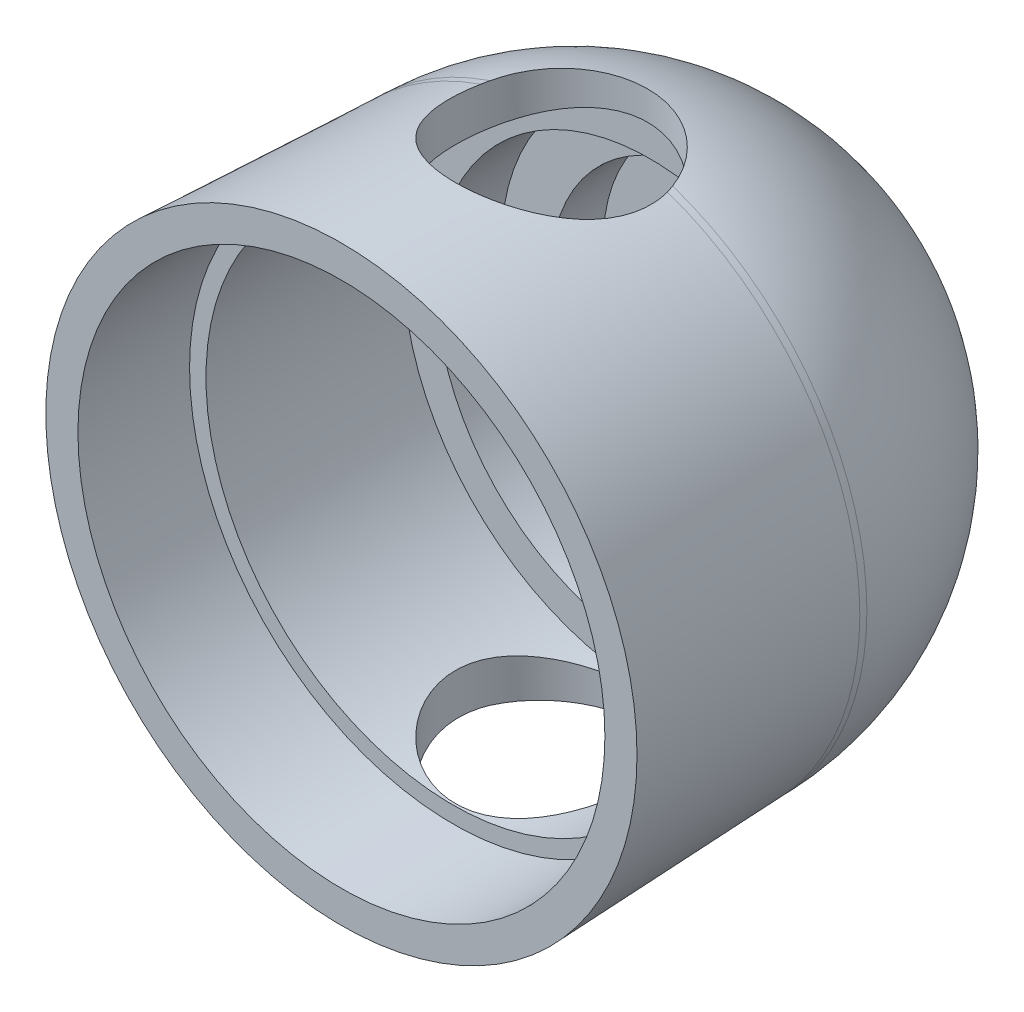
ISO-10303-21;
HEADER;
FILE_DESCRIPTION(('STEP AP214'),'2;1');
FILE_NAME('part.step','',(''),(''),'','','');
FILE_SCHEMA(('AUTOMOTIVE_DESIGN { 1 0 10303 214 1 1 1 1 }'));
ENDSEC;
DATA;
#1=APPLICATION_CONTEXT('core data for automotive mechanical design processes');
#2=APPLICATION_PROTOCOL_DEFINITION('international standard','automotive_design',2000,#1);
#3=PRODUCT_CONTEXT('',#1,'mechanical');
#4=PRODUCT('Part','Part','',(#3));
#5=PRODUCT_RELATED_PRODUCT_CATEGORY('part','',(#4));
#6=PRODUCT_DEFINITION_FORMATION('','',#4);
#7=PRODUCT_DEFINITION_CONTEXT('part definition',#1,'design');
#8=PRODUCT_DEFINITION('design','',#6,#7);
#9=PRODUCT_DEFINITION_SHAPE('','',#8);
#10=(LENGTH_UNIT() NAMED_UNIT(*) SI_UNIT(.MILLI.,.METRE.));
#11=(NAMED_UNIT(*) PLANE_ANGLE_UNIT() SI_UNIT($,.RADIAN.));
#12=(NAMED_UNIT(*) SI_UNIT($,.STERADIAN.) SOLID_ANGLE_UNIT());
#13=UNCERTAINTY_MEASURE_WITH_UNIT(LENGTH_MEASURE(1.E-05),#10,'distance_accuracy_value','');
#14=(GEOMETRIC_REPRESENTATION_CONTEXT(3) GLOBAL_UNCERTAINTY_ASSIGNED_CONTEXT((#13)) GLOBAL_UNIT_ASSIGNED_CONTEXT((#10,
#11,#12)) REPRESENTATION_CONTEXT('',''));
#15=CARTESIAN_POINT('',(0.,0.,0.));
#16=DIRECTION('',(0.,0.,1.));
#17=DIRECTION('',(1.,0.,0.));
#18=AXIS2_PLACEMENT_3D('',#15,#16,#17);
#19=CARTESIAN_POINT('',(5.69238323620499,-22.5897047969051,-35.4435));
#20=DIRECTION('',(0.,0.,1.));
#21=DIRECTION('',(1.,0.,0.));
#22=AXIS2_PLACEMENT_3D('',#19,#20,#21);
#23=CONICAL_SURFACE('',#22,43.5070489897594,0.027043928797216);
#24=CARTESIAN_POINT('',(5.69238323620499,-22.5897047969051,-35.4435));
#25=DIRECTION('',(0.,0.,1.));
#26=DIRECTION('',(1.,0.,0.));
#27=AXIS2_PLACEMENT_3D('',#24,#25,#26);
#28=CIRCLE('',#27,43.5070489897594);
#29=CARTESIAN_POINT('',(19.9062121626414,-63.7094127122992,-35.4435));
#30=VERTEX_POINT('',#29);
#31=CARTESIAN_POINT('',(19.9062121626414,18.530003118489,-35.4435));
#32=VERTEX_POINT('',#31);
#33=EDGE_CURVE('E47',#30,#32,#28,.T.);
#34=ORIENTED_EDGE('',*,*,#33,.F.);
#35=CARTESIAN_POINT('',(19.9062606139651,-63.709401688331,-35.4433));
#36=CARTESIAN_POINT('',(19.8611362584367,-63.719698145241,-35.6295348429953));
#37=CARTESIAN_POINT('',(19.8124199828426,-63.7311487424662,-35.8146697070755));
#38=CARTESIAN_POINT('',(19.7078035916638,-63.7563582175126,-36.1827394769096));
#39=CARTESIAN_POINT('',(19.6519034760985,-63.7701170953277,-36.3656743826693));
#40=CARTESIAN_POINT('',(19.5924114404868,-63.7850301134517,-36.5475093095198));
#41=B_SPLINE_CURVE_WITH_KNOTS('',3,(#35,#36,#37,#38,#39,#40),.UNSPECIFIED.,.F.,.F.,(4,2,4),(0.,
0.575337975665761,1.15067594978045),.UNSPECIFIED.);
#42=CARTESIAN_POINT('',(19.5924768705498,-63.7850137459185,-36.5473093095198));
#43=VERTEX_POINT('',#42);
#44=EDGE_CURVE('E83',#30,#43,#41,.T.);
#45=ORIENTED_EDGE('',*,*,#44,.T.);
#46=CARTESIAN_POINT('',(5.69238323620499,-22.5897047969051,-36.5473093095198));
#47=DIRECTION('',(0.,0.,1.));
#48=DIRECTION('',(1.,0.,0.));
#49=AXIS2_PLACEMENT_3D('',#46,#47,#48);
#50=CIRCLE('',#49,43.4771903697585);
#51=CARTESIAN_POINT('',(19.5924768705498,18.6056041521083,-36.5473093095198));
#52=VERTEX_POINT('',#51);
#53=EDGE_CURVE('E63',#43,#52,#50,.T.);
#54=ORIENTED_EDGE('',*,*,#53,.T.);
#55=CARTESIAN_POINT('',(19.9062606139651,18.5299920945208,-35.4433));
#56=CARTESIAN_POINT('',(19.8611362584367,18.5402885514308,-35.6295348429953));
#57=CARTESIAN_POINT('',(19.8124199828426,18.551739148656,-35.8146697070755));
#58=CARTESIAN_POINT('',(19.7078035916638,18.5769486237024,-36.1827394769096));
#59=CARTESIAN_POINT('',(19.6519034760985,18.5907075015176,-36.3656743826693));
#60=CARTESIAN_POINT('',(19.5924114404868,18.6056205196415,-36.5475093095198));
#61=B_SPLINE_CURVE_WITH_KNOTS('',3,(#55,#56,#57,#58,#59,#60),.UNSPECIFIED.,.F.,.F.,(4,2,4),(0.,
0.575337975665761,1.15067594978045),.UNSPECIFIED.);
#62=EDGE_CURVE('E139',#32,#52,#61,.T.);
#63=ORIENTED_EDGE('',*,*,#62,.F.);
#64=EDGE_LOOP('',(#34,#45,#54,#63));
#65=FACE_BOUND('',#64,.T.);
#66=ADVANCED_FACE('F34',(#65),#23,.T.);
#67=CARTESIAN_POINT('',(-8.20771039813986,18.6056041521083,-36.5473093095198));
#68=VERTEX_POINT('',#67);
#69=CARTESIAN_POINT('',(-8.20771039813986,-63.7850137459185,-36.5473093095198));
#70=VERTEX_POINT('',#69);
#71=EDGE_CURVE('E95',#68,#70,#50,.T.);
#72=ORIENTED_EDGE('',*,*,#71,.T.);
#73=CARTESIAN_POINT('',(-8.20764496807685,-63.7850301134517,-36.5475093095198));
#74=CARTESIAN_POINT('',(-8.26713700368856,-63.7701170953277,-36.3656743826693));
#75=CARTESIAN_POINT('',(-8.32303711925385,-63.7563582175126,-36.1827394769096));
#76=CARTESIAN_POINT('',(-8.42765351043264,-63.7311487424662,-35.8146697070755));
#77=CARTESIAN_POINT('',(-8.47636978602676,-63.719698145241,-35.6295348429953));
#78=CARTESIAN_POINT('',(-8.52149414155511,-63.709401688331,-35.4433));
#79=B_SPLINE_CURVE_WITH_KNOTS('',3,(#73,#74,#75,#76,#77,#78),.UNSPECIFIED.,.F.,.F.,(4,2,4),(0.,
0.57533797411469,1.15067594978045),.UNSPECIFIED.);
#80=CARTESIAN_POINT('',(-8.5214456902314,-63.7094127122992,-35.4435));
#81=VERTEX_POINT('',#80);
#82=EDGE_CURVE('E55',#70,#81,#79,.T.);
#83=ORIENTED_EDGE('',*,*,#82,.T.);
#84=CARTESIAN_POINT('',(-8.5214456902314,18.530003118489,-35.4435));
#85=VERTEX_POINT('',#84);
#86=EDGE_CURVE('E11',#85,#81,#28,.T.);
#87=ORIENTED_EDGE('',*,*,#86,.F.);
#88=CARTESIAN_POINT('',(-8.20764496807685,18.6056205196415,-36.5475093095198));
#89=CARTESIAN_POINT('',(-8.26713700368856,18.5907075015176,-36.3656743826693));
#90=CARTESIAN_POINT('',(-8.32303711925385,18.5769486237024,-36.1827394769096));
#91=CARTESIAN_POINT('',(-8.42765351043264,18.551739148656,-35.8146697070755));
#92=CARTESIAN_POINT('',(-8.47636978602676,18.5402885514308,-35.6295348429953));
#93=CARTESIAN_POINT('',(-8.52149414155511,18.5299920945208,-35.4433));
#94=B_SPLINE_CURVE_WITH_KNOTS('',3,(#88,#89,#90,#91,#92,#93),.UNSPECIFIED.,.F.,.F.,(4,2,4),(0.,
0.575337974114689,1.15067594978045),.UNSPECIFIED.);
#95=EDGE_CURVE('E134',#68,#85,#94,.T.);
#96=ORIENTED_EDGE('',*,*,#95,.F.);
#97=EDGE_LOOP('',(#72,#83,#87,#96));
#98=FACE_BOUND('',#97,.T.);
#99=ADVANCED_FACE('F156',(#98),#23,.T.);
#100=CARTESIAN_POINT('',(5.69238323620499,-22.5897047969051,0.));
#101=DIRECTION('',(0.,0.,1.));
#102=DIRECTION('',(1.,0.,0.));
#103=AXIS2_PLACEMENT_3D('',#100,#101,#102);
#104=CONICAL_SURFACE('',#103,45.0158489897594,0.0425434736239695);
#105=CARTESIAN_POINT('',(5.69238323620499,-22.5897047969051,0.));
#106=DIRECTION('',(0.,0.,1.));
#107=DIRECTION('',(1.,0.,0.));
#108=AXIS2_PLACEMENT_3D('',#105,#106,#107);
#109=CIRCLE('',#108,45.0158489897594);
#110=CARTESIAN_POINT('',(50.7082322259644,-22.5897047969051,0.));
#111=VERTEX_POINT('',#110);
#112=EDGE_CURVE('E98',#111,#111,#109,.T.);
#113=ORIENTED_EDGE('',*,*,#112,.F.);
#114=EDGE_LOOP('',(#113));
#115=FACE_BOUND('',#114,.T.);
#116=ORIENTED_EDGE('',*,*,#86,.T.);
#117=CARTESIAN_POINT('',(-8.52139723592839,-63.7094204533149,-35.4437));
#118=CARTESIAN_POINT('',(-8.56756480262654,-63.702042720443,-35.253145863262));
#119=CARTESIAN_POINT('',(-8.60990513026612,-63.6959573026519,-35.0616382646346));
#120=CARTESIAN_POINT('',(-8.68686194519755,-63.6864479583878,-34.6770143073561));
#121=CARTESIAN_POINT('',(-8.72147851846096,-63.6830240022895,-34.4838979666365));
#122=CARTESIAN_POINT('',(-8.81362144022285,-63.6768606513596,-33.9026936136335));
#123=CARTESIAN_POINT('',(-8.85946893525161,-63.6782252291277,-33.5126349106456));
#124=CARTESIAN_POINT('',(-8.91956100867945,-63.6921924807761,-32.7313524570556));
#125=CARTESIAN_POINT('',(-8.93388656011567,-63.7047662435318,-32.3401342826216));
#126=CARTESIAN_POINT('',(-8.93117071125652,-63.7410540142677,-31.5583228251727));
#127=CARTESIAN_POINT('',(-8.91412998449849,-63.7647677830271,-31.1677295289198));
#128=CARTESIAN_POINT('',(-8.8489542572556,-63.8229430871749,-30.3898743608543));
#129=CARTESIAN_POINT('',(-8.80081216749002,-63.8574070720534,-30.002613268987));
#130=CARTESIAN_POINT('',(-8.67397982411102,-63.9363641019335,-29.2341540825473));
#131=CARTESIAN_POINT('',(-8.5952880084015,-63.9808576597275,-28.8529562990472));
#132=CARTESIAN_POINT('',(-8.40811777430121,-64.0788902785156,-28.0990527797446));
#133=CARTESIAN_POINT('',(-8.29963256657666,-64.1324314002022,-27.7263490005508));
#134=CARTESIAN_POINT('',(-8.053843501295,-64.2473350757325,-26.9918192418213));
#135=CARTESIAN_POINT('',(-7.91653924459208,-64.3086977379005,-26.6299934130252));
#136=CARTESIAN_POINT('',(-7.6108330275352,-64.4392968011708,-25.9114132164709));
#137=CARTESIAN_POINT('',(-7.44180732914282,-64.5086779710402,-25.554950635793));
#138=CARTESIAN_POINT('',(-7.07596608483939,-64.6525834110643,-24.8575209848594));
#139=CARTESIAN_POINT('',(-6.87914094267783,-64.7271094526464,-24.5165593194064));
#140=CARTESIAN_POINT('',(-6.45901339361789,-64.8796101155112,-23.8520720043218));
#141=CARTESIAN_POINT('',(-6.23570534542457,-64.9575854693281,-23.5285500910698));
#142=CARTESIAN_POINT('',(-5.76400767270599,-65.1152368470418,-22.9007749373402));
#143=CARTESIAN_POINT('',(-5.51561723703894,-65.1949129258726,-22.5965223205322));
#144=CARTESIAN_POINT('',(-4.98043863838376,-65.3587268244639,-21.992331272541));
#145=CARTESIAN_POINT('',(-4.69227323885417,-65.4428620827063,-21.6936104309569));
#146=CARTESIAN_POINT('',(-4.09141183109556,-65.6089955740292,-21.1215822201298));
#147=CARTESIAN_POINT('',(-3.77872629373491,-65.6909946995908,-20.8482641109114));
#148=CARTESIAN_POINT('',(-3.13044576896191,-65.8509302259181,-20.3286267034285));
#149=CARTESIAN_POINT('',(-2.79484047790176,-65.9288647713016,-20.0823196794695));
#150=CARTESIAN_POINT('',(-2.10305072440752,-66.0786699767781,-19.6187593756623));
#151=CARTESIAN_POINT('',(-1.74687503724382,-66.1505431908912,-19.401493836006));
#152=CARTESIAN_POINT('',(-1.01556025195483,-66.2865449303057,-18.9973502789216));
#153=CARTESIAN_POINT('',(-0.640394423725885,-66.3506620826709,-18.8105167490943));
#154=CARTESIAN_POINT('',(0.125878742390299,-66.4693608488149,-18.4692739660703));
#155=CARTESIAN_POINT('',(0.516986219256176,-66.5239423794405,-18.314864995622));
#156=CARTESIAN_POINT('',(1.31216368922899,-66.6220880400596,-18.0400144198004));
#157=CARTESIAN_POINT('',(1.716229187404,-66.6656559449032,-17.9195611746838));
#158=CARTESIAN_POINT('',(2.53431841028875,-66.7405943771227,-17.7138136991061));
#159=CARTESIAN_POINT('',(2.94834155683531,-66.7719656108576,-17.6285174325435));
#160=CARTESIAN_POINT('',(3.75982191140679,-66.8202510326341,-17.497750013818));
#161=CARTESIAN_POINT('',(4.15692452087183,-66.8378704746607,-17.4503326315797));
#162=CARTESIAN_POINT('',(4.95402571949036,-66.8609916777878,-17.3881814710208));
#163=CARTESIAN_POINT('',(5.35402419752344,-66.8664939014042,-17.37344644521));
#164=CARTESIAN_POINT('',(6.15378991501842,-66.8652388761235,-17.3768123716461));
#165=CARTESIAN_POINT('',(6.55355718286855,-66.8584837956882,-17.3949075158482));
#166=CARTESIAN_POINT('',(7.34987758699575,-66.8328927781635,-17.463733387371));
#167=CARTESIAN_POINT('',(7.74643075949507,-66.8140569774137,-17.5144637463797));
#168=CARTESIAN_POINT('',(8.51979593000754,-66.7656370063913,-17.6457367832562));
#169=CARTESIAN_POINT('',(8.89681765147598,-66.7364450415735,-17.7251934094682));
#170=CARTESIAN_POINT('',(9.64254381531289,-66.6679360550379,-17.9133138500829));
#171=CARTESIAN_POINT('',(10.0112485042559,-66.6286193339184,-18.0219767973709));
#172=CARTESIAN_POINT('',(10.7379993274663,-66.5407603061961,-18.2675741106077));
#173=CARTESIAN_POINT('',(11.0960448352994,-66.4922174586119,-18.4045101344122));
#174=CARTESIAN_POINT('',(11.7992890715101,-66.3869929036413,-18.7055412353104));
#175=CARTESIAN_POINT('',(12.1444873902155,-66.3303109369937,-18.8696371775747));
#176=CARTESIAN_POINT('',(12.830245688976,-66.2082278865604,-19.2290995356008));
#177=CARTESIAN_POINT('',(13.1703518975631,-66.1426154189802,-19.4252597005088));
#178=CARTESIAN_POINT('',(13.8328714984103,-66.0055401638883,-19.843660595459));
#179=CARTESIAN_POINT('',(14.1552846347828,-65.9340772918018,-20.0659017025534));
#180=CARTESIAN_POINT('',(14.7807124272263,-65.7868603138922,-20.5350212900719));
#181=CARTESIAN_POINT('',(15.0837232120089,-65.7111053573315,-20.781904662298));
#182=CARTESIAN_POINT('',(15.6687575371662,-65.5569338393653,-21.2988311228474));
#183=CARTESIAN_POINT('',(15.9507735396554,-65.478516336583,-21.5688824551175));
#184=CARTESIAN_POINT('',(16.5076660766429,-65.3162245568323,-22.1465595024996));
#185=CARTESIAN_POINT('',(16.7812156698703,-65.2322943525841,-22.4554502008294));
#186=CARTESIAN_POINT('',(17.301377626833,-65.0653934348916,-23.095399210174));
#187=CARTESIAN_POINT('',(17.5479886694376,-64.9824227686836,-23.4264586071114));
#188=CARTESIAN_POINT('',(18.0126949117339,-64.8194517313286,-24.1088053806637));
#189=CARTESIAN_POINT('',(18.2307853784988,-64.739451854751,-24.4600961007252));
#190=CARTESIAN_POINT('',(18.6367721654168,-64.5844541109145,-25.1805912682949));
#191=CARTESIAN_POINT('',(18.8246800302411,-64.5094543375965,-25.5497887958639));
#192=CARTESIAN_POINT('',(19.1709113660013,-64.3654999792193,-26.3082789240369));
#193=CARTESIAN_POINT('',(19.328868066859,-64.2966252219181,-26.6977543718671));
#194=CARTESIAN_POINT('',(19.6110448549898,-64.1677348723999,-27.4901916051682));
#195=CARTESIAN_POINT('',(19.7352640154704,-64.1077195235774,-27.8931537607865));
#196=CARTESIAN_POINT('',(19.9486424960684,-63.9981856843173,-28.709470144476));
#197=CARTESIAN_POINT('',(20.0378174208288,-63.9486625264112,-29.1228196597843));
#198=CARTESIAN_POINT('',(20.1801446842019,-63.8613947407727,-29.9568826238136));
#199=CARTESIAN_POINT('',(20.2333005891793,-63.8236489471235,-30.3775953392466));
#200=CARTESIAN_POINT('',(20.299967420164,-63.7634922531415,-31.1875292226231));
#201=CARTESIAN_POINT('',(20.3164279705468,-63.7400611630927,-31.5764341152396));
#202=CARTESIAN_POINT('',(20.31825767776,-63.7042441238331,-32.3548039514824));
#203=CARTESIAN_POINT('',(20.3036285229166,-63.6918575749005,-32.744268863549));
#204=CARTESIAN_POINT('',(20.2432191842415,-63.6781668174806,-33.5218993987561));
#205=CARTESIAN_POINT('',(20.1973692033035,-63.6768875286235,-33.9100601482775));
#206=CARTESIAN_POINT('',(20.1054453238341,-63.6830986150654,-34.4884608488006));
#207=CARTESIAN_POINT('',(20.0709372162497,-63.6865253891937,-34.680656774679));
#208=CARTESIAN_POINT('',(19.9942709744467,-63.6960149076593,-35.0634500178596));
#209=CARTESIAN_POINT('',(19.9521128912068,-63.7020776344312,-35.254047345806));
#210=CARTESIAN_POINT('',(19.9061637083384,-63.7094204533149,-35.4437));
#211=B_SPLINE_CURVE_WITH_KNOTS('',3,(#117,#118,#119,#120,#121,#122,#123,#124,#125,#126,#127,
#128,#129,#130,#131,#132,#133,#134,#135,#136,#137,#138,#139,#140,#141,#142,#143,#144,#145,#146,
#147,#148,#149,#150,#151,#152,#153,#154,#155,#156,#157,#158,#159,#160,#161,#162,#163,#164,#165,
#166,#167,#168,#169,#170,#171,#172,#173,#174,#175,#176,#177,#178,#179,#180,#181,#182,#183,#184,
#185,#186,#187,#188,#189,#190,#191,#192,#193,#194,#195,#196,#197,#198,#199,#200,#201,#202,#203,
#204,#205,#206,#207,#208,#209,#210),.UNSPECIFIED.,.F.,.F.,(4,2,2,2,2,2,2,2,2,2,2,2,2,2,2,2,2,2,
2,2,2,2,2,2,2,2,2,2,2,2,2,2,2,2,2,2,2,2,2,2,2,2,2,2,2,2,4),(0.,0.588526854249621,
1.17704715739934,2.35373257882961,3.52739180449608,4.70102582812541,5.87492746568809,
7.04888913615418,8.22311855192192,9.39736423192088,10.5977269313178,11.7985050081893,
12.9995393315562,14.2006125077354,15.4696265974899,16.7381016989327,18.007150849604,
19.2756625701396,20.5460123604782,21.8163732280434,23.0862980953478,24.3561494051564,
25.5555795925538,26.754963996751,27.9541362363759,29.1532949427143,30.311185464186,
31.4690416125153,32.6269656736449,33.7849266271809,34.9778061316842,36.1707028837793,
37.3638369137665,38.5573972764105,39.8191035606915,41.0808716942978,42.3428489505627,
43.6043423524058,44.8804061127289,46.1565049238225,47.4320348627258,48.7074384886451,
49.8759359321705,51.0443699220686,52.2154246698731,52.8011722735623,53.3869159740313),.UNSPECIFIED.);
#212=EDGE_CURVE('E90',#81,#30,#211,.T.);
#213=ORIENTED_EDGE('',*,*,#212,.T.);
#214=ORIENTED_EDGE('',*,*,#33,.T.);
#215=CARTESIAN_POINT('',(-8.52139723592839,18.5300108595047,-35.4437));
#216=CARTESIAN_POINT('',(-8.56756480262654,18.5226331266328,-35.253145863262));
#217=CARTESIAN_POINT('',(-8.60990513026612,18.5165477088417,-35.0616382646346));
#218=CARTESIAN_POINT('',(-8.68686194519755,18.5070383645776,-34.6770143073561));
#219=CARTESIAN_POINT('',(-8.72147851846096,18.5036144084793,-34.4838979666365));
#220=CARTESIAN_POINT('',(-8.81362144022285,18.4974510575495,-33.9026936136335));
#221=CARTESIAN_POINT('',(-8.85946893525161,18.4988156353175,-33.5126349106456));
#222=CARTESIAN_POINT('',(-8.91956100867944,18.512782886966,-32.7313524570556));
#223=CARTESIAN_POINT('',(-8.93388656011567,18.5253566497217,-32.3401342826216));
#224=CARTESIAN_POINT('',(-8.93117071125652,18.5616444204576,-31.5583228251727));
#225=CARTESIAN_POINT('',(-8.91412998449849,18.585358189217,-31.1677295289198));
#226=CARTESIAN_POINT('',(-8.8489542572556,18.6435334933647,-30.3898743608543));
#227=CARTESIAN_POINT('',(-8.80081216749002,18.6779974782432,-30.002613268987));
#228=CARTESIAN_POINT('',(-8.67397982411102,18.7569545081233,-29.2341540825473));
#229=CARTESIAN_POINT('',(-8.5952880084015,18.8014480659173,-28.8529562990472));
#230=CARTESIAN_POINT('',(-8.40811777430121,18.8994806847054,-28.0990527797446));
#231=CARTESIAN_POINT('',(-8.29963256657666,18.953021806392,-27.7263490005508));
#232=CARTESIAN_POINT('',(-8.053843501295,19.0679254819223,-26.9918192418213));
#233=CARTESIAN_POINT('',(-7.91653924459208,19.1292881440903,-26.6299934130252));
#234=CARTESIAN_POINT('',(-7.6108330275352,19.2598872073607,-25.9114132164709));
#235=CARTESIAN_POINT('',(-7.44180732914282,19.32926837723,-25.554950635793));
#236=CARTESIAN_POINT('',(-7.07596608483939,19.4731738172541,-24.8575209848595));
#237=CARTESIAN_POINT('',(-6.87914094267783,19.5476998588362,-24.5165593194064));
#238=CARTESIAN_POINT('',(-6.45901339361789,19.700200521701,-23.8520720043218));
#239=CARTESIAN_POINT('',(-6.23570534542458,19.7781758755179,-23.5285500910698));
#240=CARTESIAN_POINT('',(-5.76400767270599,19.9358272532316,-22.9007749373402));
#241=CARTESIAN_POINT('',(-5.51561723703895,20.0155033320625,-22.5965223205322));
#242=CARTESIAN_POINT('',(-4.98043863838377,20.1793172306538,-21.992331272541));
#243=CARTESIAN_POINT('',(-4.69227323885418,20.2634524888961,-21.6936104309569));
#244=CARTESIAN_POINT('',(-4.09141183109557,20.429585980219,-21.1215822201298));
#245=CARTESIAN_POINT('',(-3.77872629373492,20.5115851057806,-20.8482641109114));
#246=CARTESIAN_POINT('',(-3.13044576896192,20.6715206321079,-20.3286267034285));
#247=CARTESIAN_POINT('',(-2.79484047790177,20.7494551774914,-20.0823196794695));
#248=CARTESIAN_POINT('',(-2.10305072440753,20.8992603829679,-19.6187593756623));
#249=CARTESIAN_POINT('',(-1.74687503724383,20.9711335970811,-19.401493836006));
#250=CARTESIAN_POINT('',(-1.01556025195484,21.1071353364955,-18.9973502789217));
#251=CARTESIAN_POINT('',(-0.640394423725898,21.1712524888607,-18.8105167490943));
#252=CARTESIAN_POINT('',(0.125878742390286,21.2899512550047,-18.4692739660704));
#253=CARTESIAN_POINT('',(0.516986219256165,21.3445327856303,-18.314864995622));
#254=CARTESIAN_POINT('',(1.31216368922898,21.4426784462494,-18.0400144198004));
#255=CARTESIAN_POINT('',(1.71622918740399,21.486246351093,-17.9195611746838));
#256=CARTESIAN_POINT('',(2.53431841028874,21.5611847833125,-17.7138136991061));
#257=CARTESIAN_POINT('',(2.94834155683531,21.5925560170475,-17.6285174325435));
#258=CARTESIAN_POINT('',(3.75982191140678,21.6408414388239,-17.497750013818));
#259=CARTESIAN_POINT('',(4.15692452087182,21.6584608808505,-17.4503326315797));
#260=CARTESIAN_POINT('',(4.95402571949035,21.6815820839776,-17.3881814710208));
#261=CARTESIAN_POINT('',(5.35402419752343,21.687084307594,-17.37344644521));
#262=CARTESIAN_POINT('',(6.15378991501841,21.6858292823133,-17.3768123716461));
#263=CARTESIAN_POINT('',(6.55355718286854,21.679074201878,-17.3949075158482));
#264=CARTESIAN_POINT('',(7.34987758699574,21.6534831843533,-17.463733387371));
#265=CARTESIAN_POINT('',(7.74643075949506,21.6346473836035,-17.5144637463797));
#266=CARTESIAN_POINT('',(8.51979593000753,21.5862274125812,-17.6457367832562));
#267=CARTESIAN_POINT('',(8.89681765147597,21.5570354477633,-17.7251934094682));
#268=CARTESIAN_POINT('',(9.64254381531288,21.4885264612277,-17.9133138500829));
#269=CARTESIAN_POINT('',(10.0112485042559,21.4492097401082,-18.0219767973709));
#270=CARTESIAN_POINT('',(10.7379993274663,21.361350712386,-18.2675741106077));
#271=CARTESIAN_POINT('',(11.0960448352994,21.3128078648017,-18.4045101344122));
#272=CARTESIAN_POINT('',(11.7992890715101,21.2075833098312,-18.7055412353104));
#273=CARTESIAN_POINT('',(12.1444873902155,21.1509013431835,-18.8696371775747));
#274=CARTESIAN_POINT('',(12.830245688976,21.0288182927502,-19.2290995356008));
#275=CARTESIAN_POINT('',(13.1703518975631,20.96320582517,-19.4252597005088));
#276=CARTESIAN_POINT('',(13.8328714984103,20.8261305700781,-19.843660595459));
#277=CARTESIAN_POINT('',(14.1552846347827,20.7546676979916,-20.0659017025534));
#278=CARTESIAN_POINT('',(14.7807124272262,20.607450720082,-20.5350212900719));
#279=CARTESIAN_POINT('',(15.0837232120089,20.5316957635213,-20.781904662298));
#280=CARTESIAN_POINT('',(15.6687575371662,20.3775242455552,-21.2988311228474));
#281=CARTESIAN_POINT('',(15.9507735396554,20.2991067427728,-21.5688824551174));
#282=CARTESIAN_POINT('',(16.5076660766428,20.1368149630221,-22.1465595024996));
#283=CARTESIAN_POINT('',(16.7812156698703,20.052884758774,-22.4554502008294));
#284=CARTESIAN_POINT('',(17.301377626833,19.8859838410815,-23.095399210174));
#285=CARTESIAN_POINT('',(17.5479886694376,19.8030131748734,-23.4264586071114));
#286=CARTESIAN_POINT('',(18.0126949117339,19.6400421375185,-24.1088053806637));
#287=CARTESIAN_POINT('',(18.2307853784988,19.5600422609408,-24.4600961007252));
#288=CARTESIAN_POINT('',(18.6367721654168,19.4050445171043,-25.1805912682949));
#289=CARTESIAN_POINT('',(18.8246800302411,19.3300447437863,-25.5497887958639));
#290=CARTESIAN_POINT('',(19.1709113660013,19.1860903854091,-26.3082789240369));
#291=CARTESIAN_POINT('',(19.328868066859,19.1172156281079,-26.6977543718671));
#292=CARTESIAN_POINT('',(19.6110448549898,18.9883252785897,-27.4901916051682));
#293=CARTESIAN_POINT('',(19.7352640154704,18.9283099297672,-27.8931537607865));
#294=CARTESIAN_POINT('',(19.9486424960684,18.8187760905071,-28.709470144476));
#295=CARTESIAN_POINT('',(20.0378174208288,18.769252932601,-29.1228196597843));
#296=CARTESIAN_POINT('',(20.1801446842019,18.6819851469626,-29.9568826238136));
#297=CARTESIAN_POINT('',(20.2333005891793,18.6442393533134,-30.3775953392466));
#298=CARTESIAN_POINT('',(20.299967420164,18.5840826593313,-31.1875292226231));
#299=CARTESIAN_POINT('',(20.3164279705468,18.5606515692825,-31.5764341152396));
#300=CARTESIAN_POINT('',(20.31825767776,18.524834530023,-32.3548039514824));
#301=CARTESIAN_POINT('',(20.3036285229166,18.5124479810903,-32.744268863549));
#302=CARTESIAN_POINT('',(20.2432191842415,18.4987572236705,-33.5218993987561));
#303=CARTESIAN_POINT('',(20.1973692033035,18.4974779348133,-33.9100601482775));
#304=CARTESIAN_POINT('',(20.1054453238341,18.5036890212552,-34.4884608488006));
#305=CARTESIAN_POINT('',(20.0709372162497,18.5071157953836,-34.680656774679));
#306=CARTESIAN_POINT('',(19.9942709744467,18.5166053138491,-35.0634500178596));
#307=CARTESIAN_POINT('',(19.9521128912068,18.522668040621,-35.254047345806));
#308=CARTESIAN_POINT('',(19.9061637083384,18.5300108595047,-35.4437));
#309=B_SPLINE_CURVE_WITH_KNOTS('',3,(#215,#216,#217,#218,#219,#220,#221,#222,#223,#224,#225,
#226,#227,#228,#229,#230,#231,#232,#233,#234,#235,#236,#237,#238,#239,#240,#241,#242,#243,#244,
#245,#246,#247,#248,#249,#250,#251,#252,#253,#254,#255,#256,#257,#258,#259,#260,#261,#262,#263,
#264,#265,#266,#267,#268,#269,#270,#271,#272,#273,#274,#275,#276,#277,#278,#279,#280,#281,#282,
#283,#284,#285,#286,#287,#288,#289,#290,#291,#292,#293,#294,#295,#296,#297,#298,#299,#300,#301,
#302,#303,#304,#305,#306,#307,#308),.UNSPECIFIED.,.F.,.F.,(4,2,2,2,2,2,2,2,2,2,2,2,2,2,2,2,2,2,
2,2,2,2,2,2,2,2,2,2,2,2,2,2,2,2,2,2,2,2,2,2,2,2,2,2,2,2,4),(0.,0.588526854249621,
1.17704715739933,2.3537325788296,3.52739180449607,4.70102582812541,5.87492746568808,
7.04888913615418,8.22311855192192,9.39736423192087,10.5977269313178,11.7985050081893,
12.9995393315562,14.2006125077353,15.4696265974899,16.7381016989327,18.007150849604,
19.2756625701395,20.5460123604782,21.8163732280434,23.0862980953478,24.3561494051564,
25.5555795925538,26.754963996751,27.9541362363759,29.1532949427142,30.311185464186,
31.4690416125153,32.6269656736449,33.7849266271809,34.9778061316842,36.1707028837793,
37.3638369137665,38.5573972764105,39.8191035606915,41.0808716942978,42.3428489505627,
43.6043423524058,44.8804061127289,46.1565049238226,47.4320348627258,48.7074384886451,
49.8759359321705,51.0443699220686,52.2154246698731,52.8011722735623,53.3869159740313),.UNSPECIFIED.);
#310=EDGE_CURVE('E143',#85,#32,#309,.T.);
#311=ORIENTED_EDGE('',*,*,#310,.F.);
#312=EDGE_LOOP('',(#116,#213,#214,#311));
#313=FACE_BOUND('',#312,.T.);
#314=ADVANCED_FACE('F152',(#115,#313),#104,.T.);
#315=CARTESIAN_POINT('',(5.69238323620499,-22.5897047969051,-35.4435));
#316=DIRECTION('',(0.,0.,1.));
#317=DIRECTION('',(0.,-1.,0.));
#318=AXIS2_PLACEMENT_3D('',#315,#316,#317);
#319=SPHERICAL_SURFACE('',#318,43.4912);
#320=ORIENTED_EDGE('',*,*,#53,.F.);
#321=CARTESIAN_POINT('',(19.5925422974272,-63.7849970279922,-36.5471093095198));
#322=CARTESIAN_POINT('',(19.4646394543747,-63.817691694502,-36.9382386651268));
#323=CARTESIAN_POINT('',(19.3201370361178,-63.8498959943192,-37.3239744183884));
#324=CARTESIAN_POINT('',(18.9991207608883,-63.9131087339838,-38.0819747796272));
#325=CARTESIAN_POINT('',(18.8226079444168,-63.9441172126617,-38.4542398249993));
#326=CARTESIAN_POINT('',(18.4388588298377,-64.0047081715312,-39.1824343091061));
#327=CARTESIAN_POINT('',(18.2316399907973,-64.0342914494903,-39.5383728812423));
#328=CARTESIAN_POINT('',(17.7878685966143,-64.0918493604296,-40.2315979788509));
#329=CARTESIAN_POINT('',(17.5513165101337,-64.1198240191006,-40.568884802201));
#330=CARTESIAN_POINT('',(17.0503922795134,-64.1739900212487,-41.2225763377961));
#331=CARTESIAN_POINT('',(16.786004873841,-64.2001803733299,-41.5389694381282));
#332=CARTESIAN_POINT('',(16.231380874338,-64.2505831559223,-42.1483941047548));
#333=CARTESIAN_POINT('',(15.9411443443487,-64.2747955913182,-42.4414257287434));
#334=CARTESIAN_POINT('',(15.3369439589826,-64.32107317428,-43.0019472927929));
#335=CARTESIAN_POINT('',(15.0229857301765,-64.34313882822,-43.269443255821));
#336=CARTESIAN_POINT('',(14.3735092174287,-64.384980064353,-43.7770345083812));
#337=CARTESIAN_POINT('',(14.0379910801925,-64.4047556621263,-44.0171299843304));
#338=CARTESIAN_POINT('',(13.3485893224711,-64.4418398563,-44.467650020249));
#339=CARTESIAN_POINT('',(12.9947505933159,-64.4591541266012,-44.6781428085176));
#340=CARTESIAN_POINT('',(12.2705002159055,-64.4912543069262,-45.068597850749));
#341=CARTESIAN_POINT('',(11.9000885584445,-64.5060402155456,-45.2485600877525));
#342=CARTESIAN_POINT('',(11.145274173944,-64.5329863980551,-45.5766704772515));
#343=CARTESIAN_POINT('',(10.7608693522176,-64.545146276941,-45.7248138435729));
#344=CARTESIAN_POINT('',(9.9808670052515,-64.5667559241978,-45.9881725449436));
#345=CARTESIAN_POINT('',(9.58526950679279,-64.5762056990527,-46.1033879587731));
#346=CARTESIAN_POINT('',(8.78694077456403,-64.5923069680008,-46.2997479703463));
#347=CARTESIAN_POINT('',(8.38423516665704,-64.5989669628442,-46.3809960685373));
#348=CARTESIAN_POINT('',(7.57338215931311,-64.6094860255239,-46.5093402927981));
#349=CARTESIAN_POINT('',(7.16523477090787,-64.6133450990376,-46.5564364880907));
#350=CARTESIAN_POINT('',(6.34643997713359,-64.6182363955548,-46.6161321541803));
#351=CARTESIAN_POINT('',(5.93579276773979,-64.6192688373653,-46.6287342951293));
#352=CARTESIAN_POINT('',(5.11489607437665,-64.6185006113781,-46.6193578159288));
#353=CARTESIAN_POINT('',(4.70464659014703,-64.6166999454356,-46.5973792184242));
#354=CARTESIAN_POINT('',(3.88809464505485,-64.6102824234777,-46.5190610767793));
#355=CARTESIAN_POINT('',(3.481787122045,-64.6056698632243,-46.4627739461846));
#356=CARTESIAN_POINT('',(2.67537324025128,-64.593662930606,-46.3162919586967));
#357=CARTESIAN_POINT('',(2.27526687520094,-64.5862685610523,-46.2260971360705));
#358=CARTESIAN_POINT('',(1.48409576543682,-64.568747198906,-46.0124530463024));
#359=CARTESIAN_POINT('',(1.09303100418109,-64.5586202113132,-45.8890038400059));
#360=CARTESIAN_POINT('',(0.322713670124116,-64.5357009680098,-45.6097434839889));
#361=CARTESIAN_POINT('',(-0.0565389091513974,-64.5229087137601,-45.4539323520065));
#362=CARTESIAN_POINT('',(-0.800710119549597,-64.4947379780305,-45.1109986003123));
#363=CARTESIAN_POINT('',(-1.16562253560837,-64.4793583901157,-44.9238625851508));
#364=CARTESIAN_POINT('',(-1.87836743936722,-64.446119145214,-44.5196726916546));
#365=CARTESIAN_POINT('',(-2.22619982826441,-64.4282594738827,-44.3026186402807));
#366=CARTESIAN_POINT('',(-2.90240381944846,-64.3901752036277,-43.8401050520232));
#367=CARTESIAN_POINT('',(-3.23077141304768,-64.3699501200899,-43.5946396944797));
#368=CARTESIAN_POINT('',(-3.86565633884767,-64.3272733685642,-43.0771039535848));
#369=CARTESIAN_POINT('',(-4.17217415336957,-64.3048217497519,-42.8050341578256));
#370=CARTESIAN_POINT('',(-4.76206346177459,-64.2577744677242,-42.2354167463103));
#371=CARTESIAN_POINT('',(-5.04536652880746,-64.2331728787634,-41.9377987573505));
#372=CARTESIAN_POINT('',(-5.58586451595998,-64.1820461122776,-41.3198842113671));
#373=CARTESIAN_POINT('',(-5.84305939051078,-64.1555209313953,-40.9995876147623));
#374=CARTESIAN_POINT('',(-6.32933171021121,-64.1007496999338,-40.338890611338));
#375=CARTESIAN_POINT('',(-6.55843329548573,-64.0725051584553,-39.9985078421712));
#376=CARTESIAN_POINT('',(-6.98711095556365,-64.0144751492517,-39.2999269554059));
#377=CARTESIAN_POINT('',(-7.18669840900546,-63.9846902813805,-38.9417357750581));
#378=CARTESIAN_POINT('',(-7.53567680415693,-63.9269774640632,-38.2484695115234));
#379=CARTESIAN_POINT('',(-7.68813925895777,-63.8991836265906,-37.9149247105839));
#380=CARTESIAN_POINT('',(-7.96732429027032,-63.8427203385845,-37.2380327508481));
#381=CARTESIAN_POINT('',(-8.09409413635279,-63.8140526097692,-36.894704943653));
#382=CARTESIAN_POINT('',(-8.20777582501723,-63.7849970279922,-36.5471093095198));
#383=B_SPLINE_CURVE_WITH_KNOTS('',3,(#321,#322,#323,#324,#325,#326,#327,#328,#329,#330,#331,
#332,#333,#334,#335,#336,#337,#338,#339,#340,#341,#342,#343,#344,#345,#346,#347,#348,#349,#350,
#351,#352,#353,#354,#355,#356,#357,#358,#359,#360,#361,#362,#363,#364,#365,#366,#367,#368,#369,
#370,#371,#372,#373,#374,#375,#376,#377,#378,#379,#380,#381,#382),.UNSPECIFIED.,.F.,.F.,(4,2,2,
2,2,2,2,2,2,2,2,2,2,2,2,2,2,2,2,2,2,2,2,2,2,2,2,2,2,2,4),(0.,1.23805026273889,2.47606028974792,
3.71336908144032,4.9506581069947,6.18862908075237,7.42659699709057,8.66427219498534,
9.90193897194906,11.1367047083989,12.3714711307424,13.6064231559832,14.8413722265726,
16.0725304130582,17.3036861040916,18.5347464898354,19.7658060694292,20.994989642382,
22.2241719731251,23.4533520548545,24.6825314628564,25.9122378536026,27.1419513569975,
28.3719172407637,29.6018559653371,30.8352985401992,32.0687432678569,33.3011205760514,
34.5330215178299,35.6353741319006,36.7356798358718),.UNSPECIFIED.);
#384=EDGE_CURVE('E80',#43,#70,#383,.T.);
#385=ORIENTED_EDGE('',*,*,#384,.T.);
#386=ORIENTED_EDGE('',*,*,#71,.F.);
#387=CARTESIAN_POINT('',(19.5925422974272,18.605587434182,-36.5471093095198));
#388=CARTESIAN_POINT('',(19.4646394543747,18.6382821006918,-36.9382386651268));
#389=CARTESIAN_POINT('',(19.3201370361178,18.670486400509,-37.3239744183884));
#390=CARTESIAN_POINT('',(18.9991207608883,18.7336991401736,-38.0819747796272));
#391=CARTESIAN_POINT('',(18.8226079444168,18.7647076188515,-38.4542398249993));
#392=CARTESIAN_POINT('',(18.4388588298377,18.825298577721,-39.1824343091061));
#393=CARTESIAN_POINT('',(18.2316399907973,18.8548818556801,-39.5383728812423));
#394=CARTESIAN_POINT('',(17.7878685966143,18.9124397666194,-40.2315979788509));
#395=CARTESIAN_POINT('',(17.5513165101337,18.9404144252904,-40.568884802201));
#396=CARTESIAN_POINT('',(17.0503922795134,18.9945804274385,-41.2225763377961));
#397=CARTESIAN_POINT('',(16.786004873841,19.0207707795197,-41.5389694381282));
#398=CARTESIAN_POINT('',(16.231380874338,19.0711735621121,-42.1483941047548));
#399=CARTESIAN_POINT('',(15.9411443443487,19.0953859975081,-42.4414257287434));
#400=CARTESIAN_POINT('',(15.3369439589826,19.1416635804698,-43.0019472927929));
#401=CARTESIAN_POINT('',(15.0229857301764,19.1637292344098,-43.269443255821));
#402=CARTESIAN_POINT('',(14.3735092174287,19.2055704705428,-43.7770345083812));
#403=CARTESIAN_POINT('',(14.0379910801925,19.2253460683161,-44.0171299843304));
#404=CARTESIAN_POINT('',(13.3485893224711,19.2624302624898,-44.467650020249));
#405=CARTESIAN_POINT('',(12.9947505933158,19.279744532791,-44.6781428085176));
#406=CARTESIAN_POINT('',(12.2705002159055,19.3118447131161,-45.068597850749));
#407=CARTESIAN_POINT('',(11.9000885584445,19.3266306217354,-45.2485600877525));
#408=CARTESIAN_POINT('',(11.145274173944,19.3535768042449,-45.5766704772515));
#409=CARTESIAN_POINT('',(10.7608693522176,19.3657366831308,-45.7248138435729));
#410=CARTESIAN_POINT('',(9.9808670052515,19.3873463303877,-45.9881725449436));
#411=CARTESIAN_POINT('',(9.58526950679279,19.3967961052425,-46.1033879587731));
#412=CARTESIAN_POINT('',(8.78694077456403,19.4128973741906,-46.2997479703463));
#413=CARTESIAN_POINT('',(8.38423516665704,19.419557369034,-46.3809960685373));
#414=CARTESIAN_POINT('',(7.57338215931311,19.4300764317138,-46.5093402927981));
#415=CARTESIAN_POINT('',(7.16523477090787,19.4339355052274,-46.5564364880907));
#416=CARTESIAN_POINT('',(6.34643997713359,19.4388268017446,-46.6161321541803));
#417=CARTESIAN_POINT('',(5.93579276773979,19.4398592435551,-46.6287342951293));
#418=CARTESIAN_POINT('',(5.11489607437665,19.4390910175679,-46.6193578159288));
#419=CARTESIAN_POINT('',(4.70464659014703,19.4372903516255,-46.5973792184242));
#420=CARTESIAN_POINT('',(3.88809464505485,19.4308728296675,-46.5190610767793));
#421=CARTESIAN_POINT('',(3.481787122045,19.4262602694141,-46.4627739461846));
#422=CARTESIAN_POINT('',(2.67537324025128,19.4142533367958,-46.3162919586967));
#423=CARTESIAN_POINT('',(2.27526687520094,19.4068589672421,-46.2260971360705));
#424=CARTESIAN_POINT('',(1.48409576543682,19.3893376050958,-46.0124530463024));
#425=CARTESIAN_POINT('',(1.09303100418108,19.379210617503,-45.8890038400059));
#426=CARTESIAN_POINT('',(0.322713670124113,19.3562913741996,-45.6097434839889));
#427=CARTESIAN_POINT('',(-0.056538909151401,19.3434991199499,-45.4539323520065));
#428=CARTESIAN_POINT('',(-0.800710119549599,19.3153283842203,-45.1109986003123));
#429=CARTESIAN_POINT('',(-1.16562253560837,19.2999487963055,-44.9238625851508));
#430=CARTESIAN_POINT('',(-1.87836743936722,19.2667095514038,-44.5196726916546));
#431=CARTESIAN_POINT('',(-2.22619982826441,19.2488498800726,-44.3026186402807));
#432=CARTESIAN_POINT('',(-2.90240381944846,19.2107656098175,-43.8401050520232));
#433=CARTESIAN_POINT('',(-3.23077141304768,19.1905405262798,-43.5946396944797));
#434=CARTESIAN_POINT('',(-3.86565633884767,19.1478637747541,-43.0771039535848));
#435=CARTESIAN_POINT('',(-4.17217415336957,19.1254121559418,-42.8050341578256));
#436=CARTESIAN_POINT('',(-4.76206346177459,19.078364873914,-42.2354167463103));
#437=CARTESIAN_POINT('',(-5.04536652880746,19.0537632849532,-41.9377987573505));
#438=CARTESIAN_POINT('',(-5.58586451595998,19.0026365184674,-41.3198842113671));
#439=CARTESIAN_POINT('',(-5.84305939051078,18.9761113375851,-40.9995876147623));
#440=CARTESIAN_POINT('',(-6.32933171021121,18.9213401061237,-40.338890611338));
#441=CARTESIAN_POINT('',(-6.55843329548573,18.8930955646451,-39.9985078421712));
#442=CARTESIAN_POINT('',(-6.98711095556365,18.8350655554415,-39.2999269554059));
#443=CARTESIAN_POINT('',(-7.18669840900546,18.8052806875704,-38.9417357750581));
#444=CARTESIAN_POINT('',(-7.53567680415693,18.7475678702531,-38.2484695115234));
#445=CARTESIAN_POINT('',(-7.68813925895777,18.7197740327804,-37.9149247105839));
#446=CARTESIAN_POINT('',(-7.96732429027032,18.6633107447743,-37.2380327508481));
#447=CARTESIAN_POINT('',(-8.09409413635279,18.634643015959,-36.894704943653));
#448=CARTESIAN_POINT('',(-8.20777582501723,18.605587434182,-36.5471093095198));
#449=B_SPLINE_CURVE_WITH_KNOTS('',3,(#387,#388,#389,#390,#391,#392,#393,#394,#395,#396,#397,
#398,#399,#400,#401,#402,#403,#404,#405,#406,#407,#408,#409,#410,#411,#412,#413,#414,#415,#416,
#417,#418,#419,#420,#421,#422,#423,#424,#425,#426,#427,#428,#429,#430,#431,#432,#433,#434,#435,
#436,#437,#438,#439,#440,#441,#442,#443,#444,#445,#446,#447,#448),.UNSPECIFIED.,.F.,.F.,(4,2,2,
2,2,2,2,2,2,2,2,2,2,2,2,2,2,2,2,2,2,2,2,2,2,2,2,2,2,2,4),(0.,1.2380502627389,2.47606028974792,
3.71336908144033,4.9506581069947,6.18862908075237,7.42659699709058,8.66427219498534,
9.90193897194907,11.1367047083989,12.3714711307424,13.6064231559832,14.8413722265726,
16.0725304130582,17.3036861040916,18.5347464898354,19.7658060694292,20.994989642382,
22.2241719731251,23.4533520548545,24.6825314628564,25.9122378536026,27.1419513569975,
28.3719172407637,29.6018559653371,30.8352985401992,32.0687432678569,33.3011205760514,
34.5330215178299,35.6353741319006,36.7356798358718),.UNSPECIFIED.);
#450=EDGE_CURVE('E94',#52,#68,#449,.T.);
#451=ORIENTED_EDGE('',*,*,#450,.F.);
#452=EDGE_LOOP('',(#320,#385,#386,#451));
#453=FACE_BOUND('',#452,.T.);
#454=ADVANCED_FACE('F93',(#453),#319,.T.);
#455=CARTESIAN_POINT('',(5.69238323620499,-22.5897047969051,-47.));
#456=DIRECTION('',(0.,0.,1.));
#457=DIRECTION('',(1.,0.,0.));
#458=AXIS2_PLACEMENT_3D('',#455,#456,#457);
#459=CYLINDRICAL_SURFACE('',#458,37.625);
#460=CARTESIAN_POINT('',(5.69238323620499,-22.5897047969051,-17.));
#461=DIRECTION('',(0.,0.,1.));
#462=DIRECTION('',(1.,0.,0.));
#463=AXIS2_PLACEMENT_3D('',#460,#461,#462);
#464=CIRCLE('',#463,37.625);
#465=CARTESIAN_POINT('',(43.317383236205,-22.5897047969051,-17.));
#466=VERTEX_POINT('',#465);
#467=EDGE_CURVE('E339',#466,#466,#464,.T.);
#468=ORIENTED_EDGE('',*,*,#467,.T.);
#469=EDGE_LOOP('',(#468));
#470=FACE_BOUND('',#469,.T.);
#471=CARTESIAN_POINT('',(5.69238323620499,-22.5897047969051,-47.));
#472=DIRECTION('',(0.,0.,1.));
#473=DIRECTION('',(1.,0.,0.));
#474=AXIS2_PLACEMENT_3D('',#471,#472,#473);
#475=CIRCLE('',#474,37.625);
#476=CARTESIAN_POINT('',(43.317383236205,-22.5897047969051,-47.));
#477=VERTEX_POINT('',#476);
#478=EDGE_CURVE('E337',#477,#477,#475,.T.);
#479=ORIENTED_EDGE('',*,*,#478,.F.);
#480=EDGE_LOOP('',(#479));
#481=FACE_BOUND('',#480,.T.);
#482=CARTESIAN_POINT('',(5.69238323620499,15.0352952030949,-17.375));
#483=CARTESIAN_POINT('',(6.08733589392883,15.0352971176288,-17.3749974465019));
#484=CARTESIAN_POINT('',(6.48225474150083,15.0290633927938,-17.3910105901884));
#485=CARTESIAN_POINT('',(7.26908856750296,15.0043039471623,-17.4548848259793));
#486=CARTESIAN_POINT('',(7.66100387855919,14.9857796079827,-17.502742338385));
#487=CARTESIAN_POINT('',(8.43887257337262,14.9369428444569,-17.6297978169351));
#488=CARTESIAN_POINT('',(8.82482724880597,14.9066330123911,-17.7089888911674));
#489=CARTESIAN_POINT('',(9.58814270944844,14.8350282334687,-17.8979335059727));
#490=CARTESIAN_POINT('',(9.9655032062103,14.7937329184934,-18.0076880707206));
#491=CARTESIAN_POINT('',(10.7083048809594,14.7013257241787,-18.2564829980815));
#492=CARTESIAN_POINT('',(11.0737692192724,14.6502344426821,-18.3954619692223));
#493=CARTESIAN_POINT('',(11.7913031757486,14.5394696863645,-18.7016557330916));
#494=CARTESIAN_POINT('',(12.1433729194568,14.4797962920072,-18.8688702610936));
#495=CARTESIAN_POINT('',(12.8320726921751,14.3533331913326,-19.2302428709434));
#496=CARTESIAN_POINT('',(13.1687020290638,14.2865431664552,-19.4244021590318));
#497=CARTESIAN_POINT('',(13.8247736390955,14.1474339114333,-19.8383648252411));
#498=CARTESIAN_POINT('',(14.1442091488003,14.0751125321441,-20.0581781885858));
#499=CARTESIAN_POINT('',(14.7765626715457,13.9236930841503,-20.5313271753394));
#500=CARTESIAN_POINT('',(15.0887003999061,13.8444394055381,-20.7856561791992));
#501=CARTESIAN_POINT('',(15.6908031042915,13.6838306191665,-21.3189864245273));
#502=CARTESIAN_POINT('',(15.9807578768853,13.6024745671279,-21.5979988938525));
#503=CARTESIAN_POINT('',(16.5368040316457,13.4397708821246,-22.1790572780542));
#504=CARTESIAN_POINT('',(16.8028874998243,13.3584232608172,-22.4811107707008));
#505=CARTESIAN_POINT('',(17.3094027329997,13.1979473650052,-23.1063347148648));
#506=CARTESIAN_POINT('',(17.5498456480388,13.1188181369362,-23.4294958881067));
#507=CARTESIAN_POINT('',(18.0132531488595,12.9616547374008,-24.1093063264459));
#508=CARTESIAN_POINT('',(18.235055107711,12.8838070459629,-24.466792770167));
#509=CARTESIAN_POINT('',(18.6474997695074,12.735267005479,-25.2005422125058));
#510=CARTESIAN_POINT('',(18.8381552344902,12.6645717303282,-25.5767974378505));
#511=CARTESIAN_POINT('',(19.1867525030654,12.5326154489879,-26.3457287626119));
#512=CARTESIAN_POINT('',(19.3446981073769,12.4713533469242,-26.7384029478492));
#513=CARTESIAN_POINT('',(19.626351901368,12.3603751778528,-27.5374281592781));
#514=CARTESIAN_POINT('',(19.7500622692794,12.3106583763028,-27.9437783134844));
#515=CARTESIAN_POINT('',(19.957307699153,12.2264484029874,-28.7491723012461));
#516=CARTESIAN_POINT('',(20.0423528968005,12.1913883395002,-29.1477682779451));
#517=CARTESIAN_POINT('',(20.1789597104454,12.1347134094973,-29.9516085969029));
#518=CARTESIAN_POINT('',(20.2305222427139,12.1130981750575,-30.3568527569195));
#519=CARTESIAN_POINT('',(20.2995515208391,12.0840989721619,-31.1705852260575));
#520=CARTESIAN_POINT('',(20.3170315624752,12.076709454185,-31.5790722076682));
#521=CARTESIAN_POINT('',(20.3177243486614,12.0764174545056,-32.3960714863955));
#522=CARTESIAN_POINT('',(20.3009385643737,12.0835143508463,-32.8045837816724));
#523=CARTESIAN_POINT('',(20.2355154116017,12.1110021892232,-33.5917298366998));
#524=CARTESIAN_POINT('',(20.1890250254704,12.1304966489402,-33.9705758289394));
#525=CARTESIAN_POINT('',(20.0667612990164,12.1812925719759,-34.7226866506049));
#526=CARTESIAN_POINT('',(19.9909894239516,12.2125934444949,-35.09595175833));
#527=CARTESIAN_POINT('',(19.810881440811,12.2860471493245,-35.834465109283));
#528=CARTESIAN_POINT('',(19.7065420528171,12.3282012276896,-36.199712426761));
#529=CARTESIAN_POINT('',(19.4702287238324,12.422118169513,-36.9198816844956));
#530=CARTESIAN_POINT('',(19.3382538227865,12.4738813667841,-37.2748032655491));
#531=CARTESIAN_POINT('',(19.0448986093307,12.5866525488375,-37.9790720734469));
#532=CARTESIAN_POINT('',(18.8829944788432,12.6478213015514,-38.3281751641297));
#533=CARTESIAN_POINT('',(18.5327291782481,12.7769599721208,-39.0116812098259));
#534=CARTESIAN_POINT('',(18.3443583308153,12.8449323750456,-39.3460787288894));
#535=CARTESIAN_POINT('',(17.9424503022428,12.985874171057,-39.9983272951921));
#536=CARTESIAN_POINT('',(17.7289103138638,13.0588441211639,-40.316176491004));
#537=CARTESIAN_POINT('',(17.2779719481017,13.2079368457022,-40.9336972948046));
#538=CARTESIAN_POINT('',(17.0405724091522,13.2840597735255,-41.2333680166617));
#539=CARTESIAN_POINT('',(16.5250845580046,13.4432128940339,-41.8341795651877));
#540=CARTESIAN_POINT('',(16.2452914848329,13.526341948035,-42.1338336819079));
#541=CARTESIAN_POINT('',(15.6615557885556,13.6918084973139,-42.7085917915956));
#542=CARTESIAN_POINT('',(15.3576228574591,13.7741462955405,-42.9837055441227));
#543=CARTESIAN_POINT('',(14.7270697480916,13.9359170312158,-43.5079654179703));
#544=CARTESIAN_POINT('',(14.4004358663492,14.0153481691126,-43.7570956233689));
#545=CARTESIAN_POINT('',(13.7266863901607,14.1691027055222,-44.2273998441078));
#546=CARTESIAN_POINT('',(13.3795791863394,14.2434281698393,-44.4485851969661));
#547=CARTESIAN_POINT('',(12.6604257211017,14.3862844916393,-44.8651766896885));
#548=CARTESIAN_POINT('',(12.2880428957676,14.4546868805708,-45.0600468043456));
#549=CARTESIAN_POINT('',(11.5265495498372,14.5822219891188,-45.4175272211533));
#550=CARTESIAN_POINT('',(11.1374386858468,14.6413545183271,-45.5801368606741));
#551=CARTESIAN_POINT('',(10.3454197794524,14.7486065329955,-45.8714758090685));
#552=CARTESIAN_POINT('',(9.94251714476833,14.7967302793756,-46.0002182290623));
#553=CARTESIAN_POINT('',(9.12586700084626,14.8805533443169,-46.222547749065));
#554=CARTESIAN_POINT('',(8.71212019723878,14.916253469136,-46.3161371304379));
#555=CARTESIAN_POINT('',(7.90074152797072,14.9725064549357,-46.4628498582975));
#556=CARTESIAN_POINT('',(7.50351947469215,14.9938009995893,-46.5179603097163));
#557=CARTESIAN_POINT('',(6.70542123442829,15.0237743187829,-46.5953792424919));
#558=CARTESIAN_POINT('',(6.30454518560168,15.0324535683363,-46.6176889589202));
#559=CARTESIAN_POINT('',(5.50233100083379,15.036952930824,-46.6292651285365));
#560=CARTESIAN_POINT('',(5.10099298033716,15.0327757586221,-46.6185385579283));
#561=CARTESIAN_POINT('',(4.30089519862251,15.0116851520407,-46.5641736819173));
#562=CARTESIAN_POINT('',(3.90213539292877,14.9947719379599,-46.5205359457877));
#563=CARTESIAN_POINT('',(3.12688826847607,14.9496514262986,-46.4033345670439));
#564=CARTESIAN_POINT('',(2.75016883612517,14.9219482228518,-46.3311045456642));
#565=CARTESIAN_POINT('',(2.0044544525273,14.8559880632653,-46.1575546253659));
#566=CARTESIAN_POINT('',(1.63545922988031,14.817731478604,-46.0562357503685));
#567=CARTESIAN_POINT('',(0.907530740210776,14.7316049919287,-45.8253977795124));
#568=CARTESIAN_POINT('',(0.548598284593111,14.6837343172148,-45.6958764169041));
#569=CARTESIAN_POINT('',(-0.157011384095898,14.5795353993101,-45.4097042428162));
#570=CARTESIAN_POINT('',(-0.503688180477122,14.5232068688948,-45.2530525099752));
#571=CARTESIAN_POINT('',(-1.19303370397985,14.4016160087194,-44.9086999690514));
#572=CARTESIAN_POINT('',(-1.53526814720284,14.3361359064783,-44.7202069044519));
#573=CARTESIAN_POINT('',(-2.20270505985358,14.1992104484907,-44.3170701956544));
#574=CARTESIAN_POINT('',(-2.52790729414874,14.1277650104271,-44.1024261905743));
#575=CARTESIAN_POINT('',(-3.15958951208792,13.9806165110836,-43.6483701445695));
#576=CARTESIAN_POINT('',(-3.46606637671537,13.9049127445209,-43.4089539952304));
#577=CARTESIAN_POINT('',(-4.05874481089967,13.7510425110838,-42.9067439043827));
#578=CARTESIAN_POINT('',(-4.34493908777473,13.6728751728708,-42.643941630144));
#579=CARTESIAN_POINT('',(-4.91259551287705,13.5110914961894,-42.079438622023));
#580=CARTESIAN_POINT('',(-5.19265391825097,13.4274388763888,-41.7763348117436));
#581=CARTESIAN_POINT('',(-5.72638355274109,13.2618013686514,-41.147270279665));
#582=CARTESIAN_POINT('',(-5.98005327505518,13.179816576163,-40.8213082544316));
#583=CARTESIAN_POINT('',(-6.45941802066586,13.0198197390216,-40.1483173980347));
#584=CARTESIAN_POINT('',(-6.68510347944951,12.9418090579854,-39.8012814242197));
#585=CARTESIAN_POINT('',(-7.10668142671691,12.7921352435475,-39.0884385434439));
#586=CARTESIAN_POINT('',(-7.30258587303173,12.7204695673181,-38.7226392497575));
#587=CARTESIAN_POINT('',(-7.66443695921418,12.5851951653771,-37.9716787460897));
#588=CARTESIAN_POINT('',(-7.83015493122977,12.5216489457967,-37.586395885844));
#589=CARTESIAN_POINT('',(-8.12832094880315,12.4053576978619,-36.8015585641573));
#590=CARTESIAN_POINT('',(-8.26076861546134,12.3526127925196,-36.4020039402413));
#591=CARTESIAN_POINT('',(-8.4909442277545,12.2598183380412,-35.5918081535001));
#592=CARTESIAN_POINT('',(-8.58869198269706,12.2197615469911,-35.1811734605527));
#593=CARTESIAN_POINT('',(-8.74844321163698,12.1537933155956,-34.3518966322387));
#594=CARTESIAN_POINT('',(-8.8104494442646,12.1278807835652,-33.9332551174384));
#595=CARTESIAN_POINT('',(-8.8949650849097,12.0924494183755,-33.1203830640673));
#596=CARTESIAN_POINT('',(-8.91988988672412,12.0819288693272,-32.7264456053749));
#597=CARTESIAN_POINT('',(-8.93780212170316,12.0743747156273,-31.9377245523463));
#598=CARTESIAN_POINT('',(-8.93079107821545,12.0773404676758,-31.5429409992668));
#599=CARTESIAN_POINT('',(-8.88491442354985,12.0966560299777,-30.7556077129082));
#600=CARTESIAN_POINT('',(-8.84605212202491,12.1130044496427,-30.3630577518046));
#601=CARTESIAN_POINT('',(-8.73690418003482,12.1585293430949,-29.5831122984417));
#602=CARTESIAN_POINT('',(-8.666618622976,12.1877057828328,-29.1957167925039));
#603=CARTESIAN_POINT('',(-8.49839170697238,12.2566791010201,-28.4424488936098));
#604=CARTESIAN_POINT('',(-8.40151581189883,12.2960640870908,-28.076299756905));
#605=CARTESIAN_POINT('',(-8.18008889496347,12.384705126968,-27.3537187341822));
#606=CARTESIAN_POINT('',(-8.05553875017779,12.4339608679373,-26.9972865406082));
#607=CARTESIAN_POINT('',(-7.77978208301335,12.5409547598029,-26.2962038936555));
#608=CARTESIAN_POINT('',(-7.62857462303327,12.5986932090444,-25.9515538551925));
#609=CARTESIAN_POINT('',(-7.30057113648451,12.7211207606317,-25.2757986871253));
#610=CARTESIAN_POINT('',(-7.12376582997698,12.7858123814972,-24.9446985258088));
#611=CARTESIAN_POINT('',(-6.73538525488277,12.9241795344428,-24.2800671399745));
#612=CARTESIAN_POINT('',(-6.52243319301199,12.9981534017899,-23.9474021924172));
#613=CARTESIAN_POINT('',(-6.07080950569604,13.1499742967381,-23.3009538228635));
#614=CARTESIAN_POINT('',(-5.83213704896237,13.2278214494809,-22.9871710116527));
#615=CARTESIAN_POINT('',(-5.3303976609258,13.385398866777,-22.3800162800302));
#616=CARTESIAN_POINT('',(-5.06731980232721,13.4651299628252,-22.0866536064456));
#617=CARTESIAN_POINT('',(-4.51842605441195,13.6244033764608,-21.5221690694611));
#618=CARTESIAN_POINT('',(-4.23261716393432,13.7039457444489,-21.2510404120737));
#619=CARTESIAN_POINT('',(-3.62187642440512,13.8656220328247,-20.7168482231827));
#620=CARTESIAN_POINT('',(-3.29562545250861,13.9476241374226,-20.4552502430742));
#621=CARTESIAN_POINT('',(-2.62116295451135,14.1069658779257,-19.9604605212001));
#622=CARTESIAN_POINT('',(-2.27295089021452,14.1843053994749,-19.7272694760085));
#623=CARTESIAN_POINT('',(-1.55663082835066,14.3321879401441,-19.2910150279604));
#624=CARTESIAN_POINT('',(-1.18851819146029,14.4027293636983,-19.0879586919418));
#625=CARTESIAN_POINT('',(-0.434873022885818,14.5350003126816,-18.7137525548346));
#626=CARTESIAN_POINT('',(-0.0493397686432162,14.5967294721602,-18.5426040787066));
#627=CARTESIAN_POINT('',(0.765952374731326,14.7138190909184,-18.2222350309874));
#628=CARTESIAN_POINT('',(1.19685944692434,14.7683545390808,-18.0756221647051));
#629=CARTESIAN_POINT('',(2.07195741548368,14.8632902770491,-17.822885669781));
#630=CARTESIAN_POINT('',(2.51614940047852,14.9036894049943,-17.7167653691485));
#631=CARTESIAN_POINT('',(3.41340186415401,14.9689038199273,-17.5464441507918));
#632=CARTESIAN_POINT('',(3.86645771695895,14.9937270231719,-17.4822219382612));
#633=CARTESIAN_POINT('',(4.77715240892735,15.0269203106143,-17.396504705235));
#634=CARTESIAN_POINT('',(5.23479051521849,15.0352929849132,-17.3750029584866));
#635=CARTESIAN_POINT('',(5.69238323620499,15.0352952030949,-17.375));
#636=B_SPLINE_CURVE_WITH_KNOTS('',3,(#482,#483,#484,#485,#486,#487,#488,#489,#490,#491,#492,
#493,#494,#495,#496,#497,#498,#499,#500,#501,#502,#503,#504,#505,#506,#507,#508,#509,#510,#511,
#512,#513,#514,#515,#516,#517,#518,#519,#520,#521,#522,#523,#524,#525,#526,#527,#528,#529,#530,
#531,#532,#533,#534,#535,#536,#537,#538,#539,#540,#541,#542,#543,#544,#545,#546,#547,#548,#549,
#550,#551,#552,#553,#554,#555,#556,#557,#558,#559,#560,#561,#562,#563,#564,#565,#566,#567,#568,
#569,#570,#571,#572,#573,#574,#575,#576,#577,#578,#579,#580,#581,#582,#583,#584,#585,#586,#587,
#588,#589,#590,#591,#592,#593,#594,#595,#596,#597,#598,#599,#600,#601,#602,#603,#604,#605,#606,
#607,#608,#609,#610,#611,#612,#613,#614,#615,#616,#617,#618,#619,#620,#621,#622,#623,#624,#625,
#626,#627,#628,#629,#630,#631,#632,#633,#634,#635),.UNSPECIFIED.,.T.,.F.,(4,2,2,2,2,2,2,2,2,2,2,
2,2,2,2,2,2,2,2,2,2,2,2,2,2,2,2,2,2,2,2,2,2,2,2,2,2,2,2,2,2,2,2,2,2,2,2,2,2,2,2,2,2,2,2,2,2,2,2,
2,2,2,2,2,2,2,2,2,2,2,2,2,2,2,2,2,4),(0.,1.18442786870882,2.368722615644,3.5527570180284,
4.73683110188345,5.91844222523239,7.1000422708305,8.28169523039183,9.4638096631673,
10.6935207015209,11.9237940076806,13.1544736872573,14.3846159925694,15.6665676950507,
16.9479928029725,18.2292689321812,19.5104635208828,20.7360741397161,21.9616512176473,
23.1867500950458,24.4117963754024,25.5570091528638,26.7021646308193,27.8474516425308,
28.9927784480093,30.1604672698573,31.3285841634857,32.4968314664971,33.6651356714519,
34.918645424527,36.1716544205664,37.4254264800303,38.6786882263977,39.954521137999,
41.2303802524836,42.5057447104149,43.7810263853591,44.9842744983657,46.187477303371,
47.3904260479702,48.5933539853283,49.7457676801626,50.8981408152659,52.0506066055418,
53.2031115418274,54.3902859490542,55.5774767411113,56.7648647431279,57.9526775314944,
59.2144359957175,60.4762664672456,61.7385270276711,63.0002794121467,64.2712247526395,
65.5421845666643,66.8124176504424,68.0825526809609,69.2656502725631,70.4486914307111,
71.6316096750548,72.8145247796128,73.9556238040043,75.0966866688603,76.237789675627,
77.3793074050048,78.583555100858,79.7878417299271,80.992670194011,82.197129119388,
83.4740209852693,84.7509441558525,86.0281663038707,87.3054414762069,88.6785230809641,
90.0517175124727,91.4242134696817,92.7964933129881),.UNSPECIFIED.);
#637=CARTESIAN_POINT('',(5.69238323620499,15.0352952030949,-17.375));
#638=VERTEX_POINT('',#637);
#639=EDGE_CURVE('E105',#638,#638,#636,.T.);
#640=ORIENTED_EDGE('',*,*,#639,.T.);
#641=EDGE_LOOP('',(#640));
#642=FACE_BOUND('',#641,.T.);
#643=CARTESIAN_POINT('',(5.69238323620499,-60.2147047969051,-46.625));
#644=CARTESIAN_POINT('',(5.29743057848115,-60.214706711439,-46.6250025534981));
#645=CARTESIAN_POINT('',(4.90251173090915,-60.208472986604,-46.6089894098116));
#646=CARTESIAN_POINT('',(4.11567790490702,-60.1837135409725,-46.5451151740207));
#647=CARTESIAN_POINT('',(3.72376259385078,-60.1651892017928,-46.497257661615));
#648=CARTESIAN_POINT('',(2.94589389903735,-60.1163524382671,-46.3702021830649));
#649=CARTESIAN_POINT('',(2.55993922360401,-60.0860426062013,-46.2910111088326));
#650=CARTESIAN_POINT('',(1.79662376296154,-60.0144378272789,-46.1020664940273));
#651=CARTESIAN_POINT('',(1.41926326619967,-59.9731425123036,-45.9923119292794));
#652=CARTESIAN_POINT('',(0.676461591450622,-59.8807353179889,-45.7435170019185));
#653=CARTESIAN_POINT('',(0.310997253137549,-59.8296440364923,-45.6045380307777));
#654=CARTESIAN_POINT('',(-0.406536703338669,-59.7188792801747,-45.2983442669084));
#655=CARTESIAN_POINT('',(-0.758606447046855,-59.6592058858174,-45.1311297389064));
#656=CARTESIAN_POINT('',(-1.44730621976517,-59.5327427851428,-44.7697571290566));
#657=CARTESIAN_POINT('',(-1.78393555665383,-59.4659527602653,-44.5755978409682));
#658=CARTESIAN_POINT('',(-2.44000716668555,-59.3268435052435,-44.1616351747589));
#659=CARTESIAN_POINT('',(-2.75944267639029,-59.2545221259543,-43.9418218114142));
#660=CARTESIAN_POINT('',(-3.39179619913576,-59.1031026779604,-43.4686728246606));
#661=CARTESIAN_POINT('',(-3.70393392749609,-59.0238489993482,-43.2143438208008));
#662=CARTESIAN_POINT('',(-4.30603663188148,-58.8632402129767,-42.6810135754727));
#663=CARTESIAN_POINT('',(-4.59599140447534,-58.7818841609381,-42.4020011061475));
#664=CARTESIAN_POINT('',(-5.1520375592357,-58.6191804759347,-41.8209427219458));
#665=CARTESIAN_POINT('',(-5.41812102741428,-58.5378328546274,-41.5188892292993));
#666=CARTESIAN_POINT('',(-5.92463626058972,-58.3773569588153,-40.8936652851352));
#667=CARTESIAN_POINT('',(-6.16507917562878,-58.2982277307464,-40.5705041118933));
#668=CARTESIAN_POINT('',(-6.62848667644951,-58.141064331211,-39.8906936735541));
#669=CARTESIAN_POINT('',(-6.850288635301,-58.0632166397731,-39.533207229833));
#670=CARTESIAN_POINT('',(-7.26273329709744,-57.9146765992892,-38.7994577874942));
#671=CARTESIAN_POINT('',(-7.45338876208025,-57.8439813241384,-38.4232025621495));
#672=CARTESIAN_POINT('',(-7.80198603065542,-57.7120250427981,-37.6542712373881));
#673=CARTESIAN_POINT('',(-7.95993163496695,-57.6507629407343,-37.2615970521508));
#674=CARTESIAN_POINT('',(-8.24158542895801,-57.539784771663,-36.4625718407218));
#675=CARTESIAN_POINT('',(-8.36529579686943,-57.4900679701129,-36.0562216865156));
#676=CARTESIAN_POINT('',(-8.572541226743,-57.4058579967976,-35.2508276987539));
#677=CARTESIAN_POINT('',(-8.65758642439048,-57.3707979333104,-34.8522317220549));
#678=CARTESIAN_POINT('',(-8.79419323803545,-57.3141230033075,-34.0483914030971));
#679=CARTESIAN_POINT('',(-8.84575577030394,-57.2925077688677,-33.6431472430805));
#680=CARTESIAN_POINT('',(-8.91478504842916,-57.2635085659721,-32.8294147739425));
#681=CARTESIAN_POINT('',(-8.93226509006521,-57.2561190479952,-32.4209277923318));
#682=CARTESIAN_POINT('',(-8.93295787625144,-57.2558270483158,-31.6039285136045));
#683=CARTESIAN_POINT('',(-8.91617209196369,-57.2629239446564,-31.1954162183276));
#684=CARTESIAN_POINT('',(-8.85074893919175,-57.2904117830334,-30.4082701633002));
#685=CARTESIAN_POINT('',(-8.80425855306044,-57.3099062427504,-30.0294241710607));
#686=CARTESIAN_POINT('',(-8.68199482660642,-57.3607021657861,-29.2773133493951));
#687=CARTESIAN_POINT('',(-8.60622295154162,-57.3920030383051,-28.90404824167));
#688=CARTESIAN_POINT('',(-8.42611496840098,-57.4654567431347,-28.165534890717));
#689=CARTESIAN_POINT('',(-8.32177558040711,-57.5076108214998,-27.800287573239));
#690=CARTESIAN_POINT('',(-8.08546225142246,-57.6015277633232,-27.0801183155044));
#691=CARTESIAN_POINT('',(-7.95348735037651,-57.6532909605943,-26.7251967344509));
#692=CARTESIAN_POINT('',(-7.66013213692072,-57.7660621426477,-26.0209279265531));
#693=CARTESIAN_POINT('',(-7.49822800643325,-57.8272308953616,-25.6718248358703));
#694=CARTESIAN_POINT('',(-7.14796270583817,-57.956369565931,-24.9883187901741));
#695=CARTESIAN_POINT('',(-6.95959185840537,-58.0243419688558,-24.6539212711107));
#696=CARTESIAN_POINT('',(-6.55768382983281,-58.1652837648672,-24.0016727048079));
#697=CARTESIAN_POINT('',(-6.34414384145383,-58.2382537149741,-23.683823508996));
#698=CARTESIAN_POINT('',(-5.89320547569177,-58.3873464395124,-23.0663027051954));
#699=CARTESIAN_POINT('',(-5.65580593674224,-58.4634693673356,-22.7666319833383));
#700=CARTESIAN_POINT('',(-5.1403180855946,-58.6226224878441,-22.1658204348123));
#701=CARTESIAN_POINT('',(-4.86052501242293,-58.7057515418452,-21.8661663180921));
#702=CARTESIAN_POINT('',(-4.27678931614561,-58.8712180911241,-21.2914082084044));
#703=CARTESIAN_POINT('',(-3.97285638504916,-58.9535558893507,-21.0162944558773));
#704=CARTESIAN_POINT('',(-3.3423032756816,-59.115326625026,-20.4920345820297));
#705=CARTESIAN_POINT('',(-3.01566939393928,-59.1947577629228,-20.2429043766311));
#706=CARTESIAN_POINT('',(-2.34191991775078,-59.3485122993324,-19.7726001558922));
#707=CARTESIAN_POINT('',(-1.99481271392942,-59.4228377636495,-19.5514148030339));
#708=CARTESIAN_POINT('',(-1.27565924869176,-59.5656940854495,-19.1348233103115));
#709=CARTESIAN_POINT('',(-0.903276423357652,-59.634096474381,-18.9399531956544));
#710=CARTESIAN_POINT('',(-0.141783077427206,-59.7616315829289,-18.5824727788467));
#711=CARTESIAN_POINT('',(0.247327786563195,-59.8207641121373,-18.4198631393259));
#712=CARTESIAN_POINT('',(1.03934669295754,-59.9280161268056,-18.1285241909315));
#713=CARTESIAN_POINT('',(1.44224932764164,-59.9761398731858,-17.9997817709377));
#714=CARTESIAN_POINT('',(2.25889947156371,-60.0599629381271,-17.777452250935));
#715=CARTESIAN_POINT('',(2.67264627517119,-60.0956630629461,-17.6838628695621));
#716=CARTESIAN_POINT('',(3.48402494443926,-60.1519160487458,-17.5371501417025));
#717=CARTESIAN_POINT('',(3.88124699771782,-60.1732105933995,-17.4820396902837));
#718=CARTESIAN_POINT('',(4.67934523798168,-60.2031839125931,-17.4046207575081));
#719=CARTESIAN_POINT('',(5.08022128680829,-60.2118631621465,-17.3823110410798));
#720=CARTESIAN_POINT('',(5.88243547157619,-60.2163625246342,-17.3707348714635));
#721=CARTESIAN_POINT('',(6.28377349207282,-60.2121853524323,-17.3814614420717));
#722=CARTESIAN_POINT('',(7.08387127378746,-60.1910947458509,-17.4358263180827));
#723=CARTESIAN_POINT('',(7.4826310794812,-60.17418153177,-17.4794640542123));
#724=CARTESIAN_POINT('',(8.25787820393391,-60.1290610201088,-17.5966654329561));
#725=CARTESIAN_POINT('',(8.63459763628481,-60.101357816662,-17.6688954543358));
#726=CARTESIAN_POINT('',(9.38031201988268,-60.0353976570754,-17.8424453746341));
#727=CARTESIAN_POINT('',(9.74930724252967,-59.9971410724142,-17.9437642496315));
#728=CARTESIAN_POINT('',(10.4772357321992,-59.9110145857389,-18.1746022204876));
#729=CARTESIAN_POINT('',(10.8361681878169,-59.863143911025,-18.3041235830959));
#730=CARTESIAN_POINT('',(11.5417778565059,-59.7589449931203,-18.5902957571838));
#731=CARTESIAN_POINT('',(11.8884546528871,-59.702616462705,-18.7469474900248));
#732=CARTESIAN_POINT('',(12.5778001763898,-59.5810256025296,-19.0913000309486));
#733=CARTESIAN_POINT('',(12.9200346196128,-59.5155455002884,-19.2797930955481));
#734=CARTESIAN_POINT('',(13.5874715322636,-59.3786200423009,-19.6829298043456));
#735=CARTESIAN_POINT('',(13.9126737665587,-59.3071746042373,-19.8975738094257));
#736=CARTESIAN_POINT('',(14.5443559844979,-59.1600261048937,-20.3516298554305));
#737=CARTESIAN_POINT('',(14.8508328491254,-59.084322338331,-20.5910460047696));
#738=CARTESIAN_POINT('',(15.4435112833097,-58.930452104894,-21.0932560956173));
#739=CARTESIAN_POINT('',(15.7297055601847,-58.852284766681,-21.356058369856));
#740=CARTESIAN_POINT('',(16.297361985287,-58.6905010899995,-21.920561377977));
#741=CARTESIAN_POINT('',(16.5774203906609,-58.6068484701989,-22.2236651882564));
#742=CARTESIAN_POINT('',(17.1111500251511,-58.4412109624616,-22.852729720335));
#743=CARTESIAN_POINT('',(17.3648197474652,-58.3592261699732,-23.1786917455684));
#744=CARTESIAN_POINT('',(17.8441844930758,-58.1992293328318,-23.8516826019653));
#745=CARTESIAN_POINT('',(18.0698699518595,-58.1212186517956,-24.1987185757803));
#746=CARTESIAN_POINT('',(18.4914478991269,-57.9715448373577,-24.9115614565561));
#747=CARTESIAN_POINT('',(18.6873523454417,-57.8998791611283,-25.2773607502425));
#748=CARTESIAN_POINT('',(19.0492034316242,-57.7646047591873,-26.0283212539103));
#749=CARTESIAN_POINT('',(19.2149214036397,-57.7010585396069,-26.413604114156));
#750=CARTESIAN_POINT('',(19.5130874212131,-57.584767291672,-27.1984414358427));
#751=CARTESIAN_POINT('',(19.6455350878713,-57.5320223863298,-27.5979960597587));
#752=CARTESIAN_POINT('',(19.8757107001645,-57.4392279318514,-28.4081918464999));
#753=CARTESIAN_POINT('',(19.973458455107,-57.3991711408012,-28.8188265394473));
#754=CARTESIAN_POINT('',(20.133209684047,-57.3332029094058,-29.6481033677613));
#755=CARTESIAN_POINT('',(20.1952159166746,-57.3072903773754,-30.0667448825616));
#756=CARTESIAN_POINT('',(20.2797315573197,-57.2718590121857,-30.8796169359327));
#757=CARTESIAN_POINT('',(20.3046563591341,-57.2613384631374,-31.2735543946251));
#758=CARTESIAN_POINT('',(20.3225685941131,-57.2537843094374,-32.0622754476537));
#759=CARTESIAN_POINT('',(20.3155575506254,-57.2567500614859,-32.4570590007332));
#760=CARTESIAN_POINT('',(20.2696808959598,-57.2760656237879,-33.2443922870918));
#761=CARTESIAN_POINT('',(20.2308185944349,-57.2924140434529,-33.6369422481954));
#762=CARTESIAN_POINT('',(20.1216706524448,-57.3379389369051,-34.4168877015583));
#763=CARTESIAN_POINT('',(20.051385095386,-57.367115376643,-34.8042832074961));
#764=CARTESIAN_POINT('',(19.8831581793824,-57.4360886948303,-35.5575511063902));
#765=CARTESIAN_POINT('',(19.7862822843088,-57.4754736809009,-35.923700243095));
#766=CARTESIAN_POINT('',(19.5648553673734,-57.5641147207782,-36.6462812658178));
#767=CARTESIAN_POINT('',(19.4403052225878,-57.6133704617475,-37.0027134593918));
#768=CARTESIAN_POINT('',(19.1645485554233,-57.7203643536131,-37.7037961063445));
#769=CARTESIAN_POINT('',(19.0133410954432,-57.7781028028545,-38.0484461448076));
#770=CARTESIAN_POINT('',(18.6853376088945,-57.9005303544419,-38.7242013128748));
#771=CARTESIAN_POINT('',(18.508532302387,-57.9652219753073,-39.0553014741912));
#772=CARTESIAN_POINT('',(18.1201517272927,-58.103589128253,-39.7199328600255));
#773=CARTESIAN_POINT('',(17.907199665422,-58.1775629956,-40.0525978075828));
#774=CARTESIAN_POINT('',(17.455575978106,-58.3293838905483,-40.6990461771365));
#775=CARTESIAN_POINT('',(17.2169035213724,-58.4072310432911,-41.0128289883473));
#776=CARTESIAN_POINT('',(16.7151641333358,-58.5648084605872,-41.6199837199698));
#777=CARTESIAN_POINT('',(16.4520862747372,-58.6445395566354,-41.9133463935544));
#778=CARTESIAN_POINT('',(15.9031925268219,-58.803812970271,-42.4778309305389));
#779=CARTESIAN_POINT('',(15.6173836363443,-58.8833553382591,-42.7489595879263));
#780=CARTESIAN_POINT('',(15.0066428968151,-59.0450316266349,-43.2831517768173));
#781=CARTESIAN_POINT('',(14.6803919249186,-59.1270337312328,-43.5447497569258));
#782=CARTESIAN_POINT('',(14.0059294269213,-59.2863754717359,-44.0395394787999));
#783=CARTESIAN_POINT('',(13.6577173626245,-59.3637149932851,-44.2727305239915));
#784=CARTESIAN_POINT('',(12.9413973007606,-59.5115975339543,-44.7089849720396));
#785=CARTESIAN_POINT('',(12.5732846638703,-59.5821389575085,-44.9120413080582));
#786=CARTESIAN_POINT('',(11.8196394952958,-59.7144099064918,-45.2862474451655));
#787=CARTESIAN_POINT('',(11.4341062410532,-59.7761390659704,-45.4573959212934));
#788=CARTESIAN_POINT('',(10.6188140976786,-59.8932286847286,-45.7777649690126));
#789=CARTESIAN_POINT('',(10.1879070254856,-59.947764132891,-45.9243778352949));
#790=CARTESIAN_POINT('',(9.31280905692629,-60.0426998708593,-46.177114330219));
#791=CARTESIAN_POINT('',(8.86861707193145,-60.0830989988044,-46.2832346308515));
#792=CARTESIAN_POINT('',(7.97136460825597,-60.1483134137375,-46.4535558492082));
#793=CARTESIAN_POINT('',(7.51830875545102,-60.173136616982,-46.5177780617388));
#794=CARTESIAN_POINT('',(6.60761406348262,-60.2063299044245,-46.603495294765));
#795=CARTESIAN_POINT('',(6.14997595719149,-60.2147025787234,-46.6249970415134));
#796=CARTESIAN_POINT('',(5.69238323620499,-60.2147047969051,-46.625));
#797=B_SPLINE_CURVE_WITH_KNOTS('',3,(#643,#644,#645,#646,#647,#648,#649,#650,#651,#652,#653,
#654,#655,#656,#657,#658,#659,#660,#661,#662,#663,#664,#665,#666,#667,#668,#669,#670,#671,#672,
#673,#674,#675,#676,#677,#678,#679,#680,#681,#682,#683,#684,#685,#686,#687,#688,#689,#690,#691,
#692,#693,#694,#695,#696,#697,#698,#699,#700,#701,#702,#703,#704,#705,#706,#707,#708,#709,#710,
#711,#712,#713,#714,#715,#716,#717,#718,#719,#720,#721,#722,#723,#724,#725,#726,#727,#728,#729,
#730,#731,#732,#733,#734,#735,#736,#737,#738,#739,#740,#741,#742,#743,#744,#745,#746,#747,#748,
#749,#750,#751,#752,#753,#754,#755,#756,#757,#758,#759,#760,#761,#762,#763,#764,#765,#766,#767,
#768,#769,#770,#771,#772,#773,#774,#775,#776,#777,#778,#779,#780,#781,#782,#783,#784,#785,#786,
#787,#788,#789,#790,#791,#792,#793,#794,#795,#796),.UNSPECIFIED.,.T.,.F.,(4,2,2,2,2,2,2,2,2,2,2,
2,2,2,2,2,2,2,2,2,2,2,2,2,2,2,2,2,2,2,2,2,2,2,2,2,2,2,2,2,2,2,2,2,2,2,2,2,2,2,2,2,2,2,2,2,2,2,2,
2,2,2,2,2,2,2,2,2,2,2,2,2,2,2,2,2,4),(0.,1.18442786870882,2.368722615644,3.5527570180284,
4.73683110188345,5.9184422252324,7.1000422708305,8.28169523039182,9.4638096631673,
10.6935207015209,11.9237940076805,13.1544736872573,14.3846159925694,15.6665676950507,
16.9479928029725,18.2292689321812,19.5104635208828,20.7360741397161,21.9616512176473,
23.1867500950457,24.4117963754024,25.5570091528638,26.7021646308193,27.8474516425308,
28.9927784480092,30.1604672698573,31.3285841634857,32.4968314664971,33.6651356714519,
34.918645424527,36.1716544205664,37.4254264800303,38.6786882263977,39.954521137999,
41.2303802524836,42.5057447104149,43.7810263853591,44.9842744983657,46.187477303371,
47.3904260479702,48.5933539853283,49.7457676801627,50.8981408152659,52.0506066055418,
53.2031115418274,54.3902859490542,55.5774767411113,56.7648647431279,57.9526775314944,
59.2144359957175,60.4762664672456,61.7385270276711,63.0002794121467,64.2712247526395,
65.5421845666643,66.8124176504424,68.0825526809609,69.2656502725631,70.4486914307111,
71.6316096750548,72.8145247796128,73.9556238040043,75.0966866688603,76.237789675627,
77.3793074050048,78.5835551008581,79.7878417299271,80.992670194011,82.197129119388,
83.4740209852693,84.7509441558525,86.0281663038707,87.3054414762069,88.6785230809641,
90.0517175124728,91.4242134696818,92.7964933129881),.UNSPECIFIED.);
#798=CARTESIAN_POINT('',(5.69238323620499,-60.2147047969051,-46.625));
#799=VERTEX_POINT('',#798);
#800=EDGE_CURVE('E38',#799,#799,#797,.T.);
#801=ORIENTED_EDGE('',*,*,#800,.F.);
#802=EDGE_LOOP('',(#801));
#803=FACE_BOUND('',#802,.T.);
#804=ADVANCED_FACE('F110',(#470,#481,#642,#803),#459,.F.);
#805=CARTESIAN_POINT('',(5.69238323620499,-62.6010255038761,0.));
#806=DIRECTION('',(0.,0.,1.));
#807=DIRECTION('',(1.,0.,0.));
#808=AXIS2_PLACEMENT_3D('',#805,#806,#807);
#809=PLANE('',#808);
#810=CARTESIAN_POINT('',(5.69238323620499,-22.5897047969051,0.));
#811=DIRECTION('',(0.,0.,1.));
#812=DIRECTION('',(1.,0.,0.));
#813=AXIS2_PLACEMENT_3D('',#810,#811,#812);
#814=CIRCLE('',#813,40.125);
#815=CARTESIAN_POINT('',(45.817383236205,-22.5897047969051,0.));
#816=VERTEX_POINT('',#815);
#817=EDGE_CURVE('E100',#816,#816,#814,.T.);
#818=ORIENTED_EDGE('',*,*,#817,.F.);
#819=EDGE_LOOP('',(#818));
#820=FACE_BOUND('',#819,.T.);
#821=ORIENTED_EDGE('',*,*,#112,.T.);
#822=EDGE_LOOP('',(#821));
#823=FACE_BOUND('',#822,.T.);
#824=ADVANCED_FACE('F158',(#820,#823),#809,.T.);
#825=CARTESIAN_POINT('',(5.69238323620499,-22.5897047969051,-17.));
#826=DIRECTION('',(0.,0.,1.));
#827=DIRECTION('',(1.,0.,0.));
#828=AXIS2_PLACEMENT_3D('',#825,#826,#827);
#829=CYLINDRICAL_SURFACE('',#828,40.125);
#830=CARTESIAN_POINT('',(5.69238323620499,-22.5897047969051,-17.));
#831=DIRECTION('',(0.,0.,1.));
#832=DIRECTION('',(1.,0.,0.));
#833=AXIS2_PLACEMENT_3D('',#830,#831,#832);
#834=CIRCLE('',#833,40.125);
#835=CARTESIAN_POINT('',(45.817383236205,-22.5897047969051,-17.));
#836=VERTEX_POINT('',#835);
#837=EDGE_CURVE('E96',#836,#836,#834,.T.);
#838=ORIENTED_EDGE('',*,*,#837,.F.);
#839=EDGE_LOOP('',(#838));
#840=FACE_BOUND('',#839,.T.);
#841=ORIENTED_EDGE('',*,*,#817,.T.);
#842=EDGE_LOOP('',(#841));
#843=FACE_BOUND('',#842,.T.);
#844=ADVANCED_FACE('F176',(#840,#843),#829,.F.);
#845=CARTESIAN_POINT('',(5.69238323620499,-22.5897047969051,-17.));
#846=DIRECTION('',(0.,0.,1.));
#847=DIRECTION('',(1.,0.,0.));
#848=AXIS2_PLACEMENT_3D('',#845,#846,#847);
#849=PLANE('',#848);
#850=ORIENTED_EDGE('',*,*,#467,.F.);
#851=EDGE_LOOP('',(#850));
#852=FACE_BOUND('',#851,.T.);
#853=ORIENTED_EDGE('',*,*,#837,.T.);
#854=EDGE_LOOP('',(#853));
#855=FACE_BOUND('',#854,.T.);
#856=ADVANCED_FACE('F179',(#852,#855),#849,.T.);
#857=CARTESIAN_POINT('',(5.69238323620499,-22.5897047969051,-47.));
#858=DIRECTION('',(0.,0.,1.));
#859=DIRECTION('',(1.,0.,0.));
#860=AXIS2_PLACEMENT_3D('',#857,#858,#859);
#861=PLANE('',#860);
#862=CARTESIAN_POINT('',(5.69238323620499,-22.5897047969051,-47.));
#863=DIRECTION('',(0.,0.,1.));
#864=DIRECTION('',(1.,0.,0.));
#865=AXIS2_PLACEMENT_3D('',#862,#863,#864);
#866=CIRCLE('',#865,32.625);
#867=CARTESIAN_POINT('',(38.317383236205,-22.5897047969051,-47.));
#868=VERTEX_POINT('',#867);
#869=EDGE_CURVE('E347',#868,#868,#866,.T.);
#870=ORIENTED_EDGE('',*,*,#869,.F.);
#871=EDGE_LOOP('',(#870));
#872=FACE_BOUND('',#871,.T.);
#873=ORIENTED_EDGE('',*,*,#478,.T.);
#874=EDGE_LOOP('',(#873));
#875=FACE_BOUND('',#874,.T.);
#876=ADVANCED_FACE('F182',(#872,#875),#861,.T.);
#877=CARTESIAN_POINT('',(5.69238323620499,-22.5897047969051,-57.));
#878=DIRECTION('',(0.,0.,1.));
#879=DIRECTION('',(1.,0.,0.));
#880=AXIS2_PLACEMENT_3D('',#877,#878,#879);
#881=CYLINDRICAL_SURFACE('',#880,32.625);
#882=CARTESIAN_POINT('',(5.69238323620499,-22.5897047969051,-57.));
#883=DIRECTION('',(0.,0.,1.));
#884=DIRECTION('',(1.,0.,0.));
#885=AXIS2_PLACEMENT_3D('',#882,#883,#884);
#886=CIRCLE('',#885,32.625);
#887=CARTESIAN_POINT('',(38.317383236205,-22.5897047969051,-57.));
#888=VERTEX_POINT('',#887);
#889=EDGE_CURVE('E344',#888,#888,#886,.T.);
#890=ORIENTED_EDGE('',*,*,#889,.F.);
#891=EDGE_LOOP('',(#890));
#892=FACE_BOUND('',#891,.T.);
#893=ORIENTED_EDGE('',*,*,#869,.T.);
#894=EDGE_LOOP('',(#893));
#895=FACE_BOUND('',#894,.T.);
#896=ADVANCED_FACE('F187',(#892,#895),#881,.F.);
#897=CARTESIAN_POINT('',(5.69238323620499,-22.5897047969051,-57.));
#898=DIRECTION('',(0.,0.,1.));
#899=DIRECTION('',(1.,0.,0.));
#900=AXIS2_PLACEMENT_3D('',#897,#898,#899);
#901=PLANE('',#900);
#902=CARTESIAN_POINT('',(5.69238323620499,-22.5897047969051,-57.));
#903=DIRECTION('',(0.,0.,1.));
#904=DIRECTION('',(1.,0.,0.));
#905=AXIS2_PLACEMENT_3D('',#902,#903,#904);
#906=CIRCLE('',#905,25.125);
#907=CARTESIAN_POINT('',(30.817383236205,-22.5897047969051,-57.));
#908=VERTEX_POINT('',#907);
#909=EDGE_CURVE('E353',#908,#908,#906,.T.);
#910=ORIENTED_EDGE('',*,*,#909,.F.);
#911=EDGE_LOOP('',(#910));
#912=FACE_BOUND('',#911,.T.);
#913=ORIENTED_EDGE('',*,*,#889,.T.);
#914=EDGE_LOOP('',(#913));
#915=FACE_BOUND('',#914,.T.);
#916=ADVANCED_FACE('F246',(#912,#915),#901,.T.);
#917=CARTESIAN_POINT('',(5.69238323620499,-22.5897047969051,-65.));
#918=DIRECTION('',(0.,0.,1.));
#919=DIRECTION('',(1.,0.,0.));
#920=AXIS2_PLACEMENT_3D('',#917,#918,#919);
#921=CYLINDRICAL_SURFACE('',#920,25.125);
#922=CARTESIAN_POINT('',(5.69238323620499,-22.5897047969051,-65.));
#923=DIRECTION('',(0.,0.,1.));
#924=DIRECTION('',(1.,0.,0.));
#925=AXIS2_PLACEMENT_3D('',#922,#923,#924);
#926=CIRCLE('',#925,25.125);
#927=CARTESIAN_POINT('',(30.817383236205,-22.5897047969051,-65.));
#928=VERTEX_POINT('',#927);
#929=EDGE_CURVE('E350',#928,#928,#926,.T.);
#930=ORIENTED_EDGE('',*,*,#929,.F.);
#931=EDGE_LOOP('',(#930));
#932=FACE_BOUND('',#931,.T.);
#933=ORIENTED_EDGE('',*,*,#909,.T.);
#934=EDGE_LOOP('',(#933));
#935=FACE_BOUND('',#934,.T.);
#936=ADVANCED_FACE('F238',(#932,#935),#921,.F.);
#937=CARTESIAN_POINT('',(5.69238323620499,-22.5897047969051,-65.));
#938=DIRECTION('',(0.,0.,1.));
#939=DIRECTION('',(1.,0.,0.));
#940=AXIS2_PLACEMENT_3D('',#937,#938,#939);
#941=PLANE('',#940);
#942=CARTESIAN_POINT('',(5.69238323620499,-22.5897047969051,-65.));
#943=DIRECTION('',(0.,0.,1.));
#944=DIRECTION('',(1.,0.,0.));
#945=AXIS2_PLACEMENT_3D('',#942,#943,#944);
#946=CIRCLE('',#945,17.625);
#947=CARTESIAN_POINT('',(23.317383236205,-22.5897047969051,-65.));
#948=VERTEX_POINT('',#947);
#949=EDGE_CURVE('E149',#948,#948,#946,.T.);
#950=ORIENTED_EDGE('',*,*,#949,.F.);
#951=EDGE_LOOP('',(#950));
#952=FACE_BOUND('',#951,.T.);
#953=ORIENTED_EDGE('',*,*,#929,.T.);
#954=EDGE_LOOP('',(#953));
#955=FACE_BOUND('',#954,.T.);
#956=ADVANCED_FACE('F231',(#952,#955),#941,.T.);
#957=CARTESIAN_POINT('',(5.69238323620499,-22.5897047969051,-68.));
#958=DIRECTION('',(0.,0.,1.));
#959=DIRECTION('',(1.,0.,0.));
#960=AXIS2_PLACEMENT_3D('',#957,#958,#959);
#961=CYLINDRICAL_SURFACE('',#960,17.625);
#962=CARTESIAN_POINT('',(5.69238323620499,-22.5897047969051,-68.));
#963=DIRECTION('',(0.,0.,1.));
#964=DIRECTION('',(1.,0.,0.));
#965=AXIS2_PLACEMENT_3D('',#962,#963,#964);
#966=CIRCLE('',#965,17.625);
#967=CARTESIAN_POINT('',(23.317383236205,-22.5897047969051,-68.));
#968=VERTEX_POINT('',#967);
#969=EDGE_CURVE('E150',#968,#968,#966,.T.);
#970=ORIENTED_EDGE('',*,*,#969,.F.);
#971=EDGE_LOOP('',(#970));
#972=FACE_BOUND('',#971,.T.);
#973=ORIENTED_EDGE('',*,*,#949,.T.);
#974=EDGE_LOOP('',(#973));
#975=FACE_BOUND('',#974,.T.);
#976=ADVANCED_FACE('F224',(#972,#975),#961,.F.);
#977=CARTESIAN_POINT('',(5.69238323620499,-22.5897047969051,-68.));
#978=DIRECTION('',(0.,0.,1.));
#979=DIRECTION('',(1.,0.,0.));
#980=AXIS2_PLACEMENT_3D('',#977,#978,#979);
#981=PLANE('',#980);
#982=ORIENTED_EDGE('',*,*,#969,.T.);
#983=EDGE_LOOP('',(#982));
#984=FACE_BOUND('',#983,.T.);
#985=ADVANCED_FACE('F118',(#984),#981,.T.);
#986=CARTESIAN_POINT('',(5.69238323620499,2.91029520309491,-32.));
#987=DIRECTION('',(0.,1.,0.));
#988=DIRECTION('',(0.,0.,1.));
#989=AXIS2_PLACEMENT_3D('',#986,#987,#988);
#990=CYLINDRICAL_SURFACE('',#989,14.625);
#991=ORIENTED_EDGE('',*,*,#310,.T.);
#992=ORIENTED_EDGE('',*,*,#62,.T.);
#993=ORIENTED_EDGE('',*,*,#450,.T.);
#994=ORIENTED_EDGE('',*,*,#95,.T.);
#995=EDGE_LOOP('',(#991,#992,#993,#994));
#996=FACE_BOUND('',#995,.T.);
#997=ORIENTED_EDGE('',*,*,#639,.F.);
#998=EDGE_LOOP('',(#997));
#999=FACE_BOUND('',#998,.T.);
#1000=ADVANCED_FACE('F114',(#996,#999),#990,.F.);
#1001=CARTESIAN_POINT('',(5.69238323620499,-48.0897047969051,-32.));
#1002=DIRECTION('',(0.,-1.,0.));
#1003=DIRECTION('',(0.,0.,-1.));
#1004=AXIS2_PLACEMENT_3D('',#1001,#1002,#1003);
#1005=CYLINDRICAL_SURFACE('',#1004,14.625);
#1006=ORIENTED_EDGE('',*,*,#82,.F.);
#1007=ORIENTED_EDGE('',*,*,#384,.F.);
#1008=ORIENTED_EDGE('',*,*,#44,.F.);
#1009=ORIENTED_EDGE('',*,*,#212,.F.);
#1010=EDGE_LOOP('',(#1006,#1007,#1008,#1009));
#1011=FACE_BOUND('',#1010,.T.);
#1012=ORIENTED_EDGE('',*,*,#800,.T.);
#1013=EDGE_LOOP('',(#1012));
#1014=FACE_BOUND('',#1013,.T.);
#1015=ADVANCED_FACE('F81',(#1011,#1014),#1005,.F.);
#1016=CLOSED_SHELL('',(#66,#99,#314,#454,#804,#824,#844,#856,#876,#896,#916,#936,#956,#976,#985,
#1000,#1015));
#1017=MANIFOLD_SOLID_BREP('B2',#1016);
#1018=ADVANCED_BREP_SHAPE_REPRESENTATION('',(#18,#1017),#14);
#1019=SHAPE_DEFINITION_REPRESENTATION(#9,#1018);
ENDSEC;
END-ISO-10303-21;
